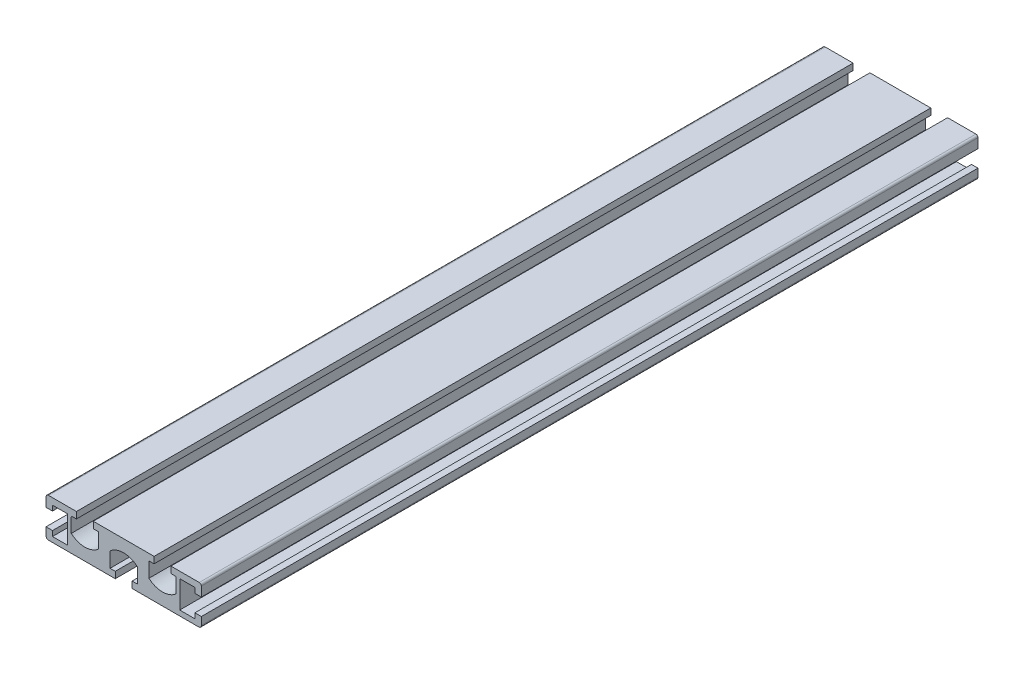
ISO-10303-21;
HEADER;
FILE_DESCRIPTION(('STEP AP214'),'2;1');
FILE_NAME('part.step','',(''),(''),'','','');
FILE_SCHEMA(('AUTOMOTIVE_DESIGN { 1 0 10303 214 1 1 1 1 }'));
ENDSEC;
DATA;
#1=APPLICATION_CONTEXT('core data for automotive mechanical design processes');
#2=APPLICATION_PROTOCOL_DEFINITION('international standard','automotive_design',2000,#1);
#3=PRODUCT_CONTEXT('',#1,'mechanical');
#4=PRODUCT('Part','Part','',(#3));
#5=PRODUCT_RELATED_PRODUCT_CATEGORY('part','',(#4));
#6=PRODUCT_DEFINITION_FORMATION('','',#4);
#7=PRODUCT_DEFINITION_CONTEXT('part definition',#1,'design');
#8=PRODUCT_DEFINITION('design','',#6,#7);
#9=PRODUCT_DEFINITION_SHAPE('','',#8);
#10=(LENGTH_UNIT() NAMED_UNIT(*) SI_UNIT(.MILLI.,.METRE.));
#11=(NAMED_UNIT(*) PLANE_ANGLE_UNIT() SI_UNIT($,.RADIAN.));
#12=(NAMED_UNIT(*) SI_UNIT($,.STERADIAN.) SOLID_ANGLE_UNIT());
#13=UNCERTAINTY_MEASURE_WITH_UNIT(LENGTH_MEASURE(1.E-05),#10,'distance_accuracy_value','');
#14=(GEOMETRIC_REPRESENTATION_CONTEXT(3) GLOBAL_UNCERTAINTY_ASSIGNED_CONTEXT((#13)) GLOBAL_UNIT_ASSIGNED_CONTEXT((#10,
#11,#12)) REPRESENTATION_CONTEXT('',''));
#15=CARTESIAN_POINT('',(0.,0.,0.));
#16=DIRECTION('',(0.,0.,1.));
#17=DIRECTION('',(1.,0.,0.));
#18=AXIS2_PLACEMENT_3D('',#15,#16,#17);
#19=CARTESIAN_POINT('',(9.74982438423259,-0.58926117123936,150.));
#20=DIRECTION('',(-0.999999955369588,0.000298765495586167,0.));
#21=DIRECTION('',(-0.000298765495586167,-0.999999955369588,0.));
#22=AXIS2_PLACEMENT_3D('',#19,#20,#21);
#23=PLANE('',#22);
#24=DIRECTION('',(0.000298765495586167,0.999999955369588,0.));
#25=VECTOR('',#24,1.);
#26=CARTESIAN_POINT('',(9.74982438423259,-0.58926117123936,-150.));
#27=LINE('',#26,#25);
#28=CARTESIAN_POINT('',(9.74982438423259,-0.589261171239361,-150.));
#29=VERTEX_POINT('',#28);
#30=CARTESIAN_POINT('',(9.75156808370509,5.24708680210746,-150.));
#31=VERTEX_POINT('',#30);
#32=EDGE_CURVE('E371',#29,#31,#27,.T.);
#33=ORIENTED_EDGE('',*,*,#32,.T.);
#34=DIRECTION('',(0.,0.,-1.));
#35=VECTOR('',#34,1.);
#36=CARTESIAN_POINT('',(9.75156808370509,5.24708680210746,150.));
#37=LINE('',#36,#35);
#38=CARTESIAN_POINT('',(9.75156808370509,5.24708680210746,150.));
#39=VERTEX_POINT('',#38);
#40=EDGE_CURVE('E11',#39,#31,#37,.T.);
#41=ORIENTED_EDGE('',*,*,#40,.F.);
#42=DIRECTION('',(0.000298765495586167,0.999999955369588,0.));
#43=VECTOR('',#42,1.);
#44=CARTESIAN_POINT('',(9.74982438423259,-0.58926117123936,150.));
#45=LINE('',#44,#43);
#46=CARTESIAN_POINT('',(9.74982438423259,-0.589261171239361,150.));
#47=VERTEX_POINT('',#46);
#48=EDGE_CURVE('E465',#47,#39,#45,.T.);
#49=ORIENTED_EDGE('',*,*,#48,.F.);
#50=DIRECTION('',(0.,0.,-1.));
#51=VECTOR('',#50,1.);
#52=CARTESIAN_POINT('',(9.74982438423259,-0.589261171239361,150.));
#53=LINE('',#52,#51);
#54=EDGE_CURVE('E367',#47,#29,#53,.T.);
#55=ORIENTED_EDGE('',*,*,#54,.T.);
#56=EDGE_LOOP('',(#33,#41,#49,#55));
#57=FACE_BOUND('',#56,.T.);
#58=ADVANCED_FACE('F35',(#57),#23,.F.);
#59=CARTESIAN_POINT('',(9.75156808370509,5.24708680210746,150.));
#60=DIRECTION('',(0.00029876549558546,0.999999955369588,0.));
#61=DIRECTION('',(-0.999999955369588,0.00029876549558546,0.));
#62=AXIS2_PLACEMENT_3D('',#59,#60,#61);
#63=PLANE('',#62);
#64=DIRECTION('',(0.999999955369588,-0.00029876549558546,0.));
#65=VECTOR('',#64,1.);
#66=CARTESIAN_POINT('',(9.75156808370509,5.24708680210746,-150.));
#67=LINE('',#66,#65);
#68=CARTESIAN_POINT('',(11.7515679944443,5.24648927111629,-150.));
#69=VERTEX_POINT('',#68);
#70=EDGE_CURVE('E374',#31,#69,#67,.T.);
#71=ORIENTED_EDGE('',*,*,#70,.T.);
#72=DIRECTION('',(0.,0.,-1.));
#73=VECTOR('',#72,1.);
#74=CARTESIAN_POINT('',(11.7515679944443,5.24648927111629,150.));
#75=LINE('',#74,#73);
#76=CARTESIAN_POINT('',(11.7515679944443,5.24648927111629,150.));
#77=VERTEX_POINT('',#76);
#78=EDGE_CURVE('E43',#77,#69,#75,.T.);
#79=ORIENTED_EDGE('',*,*,#78,.F.);
#80=DIRECTION('',(0.999999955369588,-0.00029876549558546,0.));
#81=VECTOR('',#80,1.);
#82=CARTESIAN_POINT('',(9.75156808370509,5.24708680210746,150.));
#83=LINE('',#82,#81);
#84=EDGE_CURVE('E214',#39,#77,#83,.T.);
#85=ORIENTED_EDGE('',*,*,#84,.F.);
#86=ORIENTED_EDGE('',*,*,#40,.T.);
#87=EDGE_LOOP('',(#71,#79,#85,#86));
#88=FACE_BOUND('',#87,.T.);
#89=ADVANCED_FACE('F723',(#88),#63,.F.);
#90=CARTESIAN_POINT('',(11.7515679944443,5.24648927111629,150.));
#91=DIRECTION('',(-0.999999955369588,0.000298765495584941,0.));
#92=DIRECTION('',(-0.000298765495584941,-0.999999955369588,0.));
#93=AXIS2_PLACEMENT_3D('',#90,#91,#92);
#94=PLANE('',#93);
#95=DIRECTION('',(0.000298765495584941,0.999999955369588,0.));
#96=VECTOR('',#95,1.);
#97=CARTESIAN_POINT('',(11.7515679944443,5.24648927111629,-150.));
#98=LINE('',#97,#96);
#99=CARTESIAN_POINT('',(11.7523149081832,7.74648915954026,-150.));
#100=VERTEX_POINT('',#99);
#101=EDGE_CURVE('E376',#69,#100,#98,.T.);
#102=ORIENTED_EDGE('',*,*,#101,.T.);
#103=DIRECTION('',(0.,0.,-1.));
#104=VECTOR('',#103,1.);
#105=CARTESIAN_POINT('',(11.7523149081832,7.74648915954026,150.));
#106=LINE('',#105,#104);
#107=CARTESIAN_POINT('',(11.7523149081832,7.74648915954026,150.));
#108=VERTEX_POINT('',#107);
#109=EDGE_CURVE('E592',#108,#100,#106,.T.);
#110=ORIENTED_EDGE('',*,*,#109,.F.);
#111=DIRECTION('',(0.000298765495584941,0.999999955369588,0.));
#112=VECTOR('',#111,1.);
#113=CARTESIAN_POINT('',(11.7515679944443,5.24648927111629,150.));
#114=LINE('',#113,#112);
#115=EDGE_CURVE('E600',#77,#108,#114,.T.);
#116=ORIENTED_EDGE('',*,*,#115,.F.);
#117=ORIENTED_EDGE('',*,*,#78,.T.);
#118=EDGE_LOOP('',(#102,#110,#116,#117));
#119=FACE_BOUND('',#118,.T.);
#120=ADVANCED_FACE('F598',(#119),#94,.F.);
#121=CARTESIAN_POINT('',(11.7523149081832,7.74648915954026,150.));
#122=DIRECTION('',(-0.000298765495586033,-0.999999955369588,0.));
#123=DIRECTION('',(0.999999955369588,-0.000298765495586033,0.));
#124=AXIS2_PLACEMENT_3D('',#121,#122,#123);
#125=PLANE('',#124);
#126=DIRECTION('',(-0.999999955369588,0.000298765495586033,0.));
#127=VECTOR('',#126,1.);
#128=CARTESIAN_POINT('',(11.7523149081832,7.74648915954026,-150.));
#129=LINE('',#128,#127);
#130=CARTESIAN_POINT('',(-11.7476840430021,7.75351014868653,-150.));
#131=VERTEX_POINT('',#130);
#132=EDGE_CURVE('E378',#100,#131,#129,.T.);
#133=ORIENTED_EDGE('',*,*,#132,.T.);
#134=DIRECTION('',(0.,0.,-1.));
#135=VECTOR('',#134,1.);
#136=CARTESIAN_POINT('',(-11.7476840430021,7.75351014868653,150.));
#137=LINE('',#136,#135);
#138=CARTESIAN_POINT('',(-11.7476840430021,7.75351014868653,150.));
#139=VERTEX_POINT('',#138);
#140=EDGE_CURVE('E589',#139,#131,#137,.T.);
#141=ORIENTED_EDGE('',*,*,#140,.F.);
#142=DIRECTION('',(-0.999999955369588,0.000298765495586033,0.));
#143=VECTOR('',#142,1.);
#144=CARTESIAN_POINT('',(11.7523149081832,7.74648915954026,150.));
#145=LINE('',#144,#143);
#146=EDGE_CURVE('E618',#108,#139,#145,.T.);
#147=ORIENTED_EDGE('',*,*,#146,.F.);
#148=ORIENTED_EDGE('',*,*,#109,.T.);
#149=EDGE_LOOP('',(#133,#141,#147,#148));
#150=FACE_BOUND('',#149,.T.);
#151=ADVANCED_FACE('F609',(#150),#125,.F.);
#152=CARTESIAN_POINT('',(-11.7476840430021,7.75351014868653,150.));
#153=DIRECTION('',(0.999999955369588,-0.000298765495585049,0.));
#154=DIRECTION('',(0.000298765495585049,0.999999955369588,0.));
#155=AXIS2_PLACEMENT_3D('',#152,#153,#154);
#156=PLANE('',#155);
#157=DIRECTION('',(-0.000298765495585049,-0.999999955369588,0.));
#158=VECTOR('',#157,1.);
#159=CARTESIAN_POINT('',(-11.7476840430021,7.75351014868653,-150.));
#160=LINE('',#159,#158);
#161=CARTESIAN_POINT('',(-11.7484309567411,5.25351026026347,-150.));
#162=VERTEX_POINT('',#161);
#163=EDGE_CURVE('E380',#131,#162,#160,.T.);
#164=ORIENTED_EDGE('',*,*,#163,.T.);
#165=DIRECTION('',(0.,0.,-1.));
#166=VECTOR('',#165,1.);
#167=CARTESIAN_POINT('',(-11.7484309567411,5.25351026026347,150.));
#168=LINE('',#167,#166);
#169=CARTESIAN_POINT('',(-11.7484309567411,5.25351026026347,150.));
#170=VERTEX_POINT('',#169);
#171=EDGE_CURVE('E586',#170,#162,#168,.T.);
#172=ORIENTED_EDGE('',*,*,#171,.F.);
#173=DIRECTION('',(-0.000298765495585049,-0.999999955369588,0.));
#174=VECTOR('',#173,1.);
#175=CARTESIAN_POINT('',(-11.7476840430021,7.75351014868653,150.));
#176=LINE('',#175,#174);
#177=EDGE_CURVE('E615',#139,#170,#176,.T.);
#178=ORIENTED_EDGE('',*,*,#177,.F.);
#179=ORIENTED_EDGE('',*,*,#140,.T.);
#180=EDGE_LOOP('',(#164,#172,#178,#179));
#181=FACE_BOUND('',#180,.T.);
#182=ADVANCED_FACE('F613',(#181),#156,.F.);
#183=CARTESIAN_POINT('',(-11.7484309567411,5.25351026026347,150.));
#184=DIRECTION('',(0.000298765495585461,0.999999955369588,0.));
#185=DIRECTION('',(-0.999999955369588,0.000298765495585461,0.));
#186=AXIS2_PLACEMENT_3D('',#183,#184,#185);
#187=PLANE('',#186);
#188=DIRECTION('',(0.999999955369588,-0.000298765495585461,0.));
#189=VECTOR('',#188,1.);
#190=CARTESIAN_POINT('',(-11.7484309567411,5.25351026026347,-150.));
#191=LINE('',#190,#189);
#192=CARTESIAN_POINT('',(-9.74843104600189,5.2529127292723,-150.));
#193=VERTEX_POINT('',#192);
#194=EDGE_CURVE('E382',#162,#193,#191,.T.);
#195=ORIENTED_EDGE('',*,*,#194,.T.);
#196=DIRECTION('',(0.,0.,-1.));
#197=VECTOR('',#196,1.);
#198=CARTESIAN_POINT('',(-9.74843104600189,5.2529127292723,150.));
#199=LINE('',#198,#197);
#200=CARTESIAN_POINT('',(-9.74843104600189,5.2529127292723,150.));
#201=VERTEX_POINT('',#200);
#202=EDGE_CURVE('E583',#201,#193,#199,.T.);
#203=ORIENTED_EDGE('',*,*,#202,.F.);
#204=DIRECTION('',(0.999999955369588,-0.000298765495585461,0.));
#205=VECTOR('',#204,1.);
#206=CARTESIAN_POINT('',(-11.7484309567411,5.25351026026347,150.));
#207=LINE('',#206,#205);
#208=EDGE_CURVE('E617',#170,#201,#207,.T.);
#209=ORIENTED_EDGE('',*,*,#208,.F.);
#210=ORIENTED_EDGE('',*,*,#171,.T.);
#211=EDGE_LOOP('',(#195,#203,#209,#210));
#212=FACE_BOUND('',#211,.T.);
#213=ADVANCED_FACE('F736',(#212),#187,.F.);
#214=CARTESIAN_POINT('',(-9.74843104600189,5.2529127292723,150.));
#215=DIRECTION('',(0.999999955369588,-0.000298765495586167,0.));
#216=DIRECTION('',(0.000298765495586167,0.999999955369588,0.));
#217=AXIS2_PLACEMENT_3D('',#214,#215,#216);
#218=PLANE('',#217);
#219=DIRECTION('',(-0.000298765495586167,-0.999999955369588,0.));
#220=VECTOR('',#219,1.);
#221=CARTESIAN_POINT('',(-9.74843104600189,5.2529127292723,-150.));
#222=LINE('',#221,#220);
#223=CARTESIAN_POINT('',(-9.75017474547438,-0.583435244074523,-150.));
#224=VERTEX_POINT('',#223);
#225=EDGE_CURVE('E384',#193,#224,#222,.T.);
#226=ORIENTED_EDGE('',*,*,#225,.T.);
#227=DIRECTION('',(0.,0.,-1.));
#228=VECTOR('',#227,1.);
#229=CARTESIAN_POINT('',(-9.75017474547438,-0.583435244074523,150.));
#230=LINE('',#229,#228);
#231=CARTESIAN_POINT('',(-9.75017474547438,-0.583435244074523,150.));
#232=VERTEX_POINT('',#231);
#233=EDGE_CURVE('E580',#232,#224,#230,.T.);
#234=ORIENTED_EDGE('',*,*,#233,.F.);
#235=DIRECTION('',(-0.000298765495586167,-0.999999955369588,0.));
#236=VECTOR('',#235,1.);
#237=CARTESIAN_POINT('',(-9.74843104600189,5.2529127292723,150.));
#238=LINE('',#237,#236);
#239=EDGE_CURVE('E620',#201,#232,#238,.T.);
#240=ORIENTED_EDGE('',*,*,#239,.F.);
#241=ORIENTED_EDGE('',*,*,#202,.T.);
#242=EDGE_LOOP('',(#226,#234,#240,#241));
#243=FACE_BOUND('',#242,.T.);
#244=ADVANCED_FACE('F739',(#243),#218,.F.);
#245=CARTESIAN_POINT('',(-14.9983710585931,5.45448123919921,150.));
#246=DIRECTION('',(0.,0.,-1.));
#247=DIRECTION('',(-1.,0.,0.));
#248=AXIS2_PLACEMENT_3D('',#245,#246,#247);
#249=CYLINDRICAL_SURFACE('',#248,8.00000000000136);
#250=CARTESIAN_POINT('',(-14.9983710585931,5.45448123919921,-150.));
#251=DIRECTION('',(0.,0.,-1.));
#252=DIRECTION('',(1.,0.,0.));
#253=AXIS2_PLACEMENT_3D('',#250,#251,#252);
#254=CIRCLE('',#253,8.00000000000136);
#255=CARTESIAN_POINT('',(-20.2501742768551,-0.580298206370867,-150.));
#256=VERTEX_POINT('',#255);
#257=EDGE_CURVE('E386',#224,#256,#254,.T.);
#258=ORIENTED_EDGE('',*,*,#257,.T.);
#259=DIRECTION('',(0.,0.,-1.));
#260=VECTOR('',#259,1.);
#261=CARTESIAN_POINT('',(-20.2501742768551,-0.580298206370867,150.));
#262=LINE('',#261,#260);
#263=CARTESIAN_POINT('',(-20.2501742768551,-0.580298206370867,150.));
#264=VERTEX_POINT('',#263);
#265=EDGE_CURVE('E577',#264,#256,#262,.T.);
#266=ORIENTED_EDGE('',*,*,#265,.F.);
#267=CARTESIAN_POINT('',(-14.9983710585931,5.45448123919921,150.));
#268=DIRECTION('',(0.,0.,-1.));
#269=DIRECTION('',(1.,0.,0.));
#270=AXIS2_PLACEMENT_3D('',#267,#268,#269);
#271=CIRCLE('',#270,8.00000000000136);
#272=EDGE_CURVE('E626',#232,#264,#271,.T.);
#273=ORIENTED_EDGE('',*,*,#272,.F.);
#274=ORIENTED_EDGE('',*,*,#233,.T.);
#275=EDGE_LOOP('',(#258,#266,#273,#274));
#276=FACE_BOUND('',#275,.T.);
#277=ADVANCED_FACE('F743',(#276),#249,.F.);
#278=CARTESIAN_POINT('',(-20.2501742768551,-0.580298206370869,150.));
#279=DIRECTION('',(-0.999999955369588,0.000298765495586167,0.));
#280=DIRECTION('',(-0.000298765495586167,-0.999999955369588,0.));
#281=AXIS2_PLACEMENT_3D('',#278,#279,#280);
#282=PLANE('',#281);
#283=DIRECTION('',(0.000298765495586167,0.999999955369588,0.));
#284=VECTOR('',#283,1.);
#285=CARTESIAN_POINT('',(-20.2501742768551,-0.580298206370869,-150.));
#286=LINE('',#285,#284);
#287=CARTESIAN_POINT('',(-20.2484305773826,5.25604976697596,-150.));
#288=VERTEX_POINT('',#287);
#289=EDGE_CURVE('E388',#256,#288,#286,.T.);
#290=ORIENTED_EDGE('',*,*,#289,.T.);
#291=DIRECTION('',(0.,0.,-1.));
#292=VECTOR('',#291,1.);
#293=CARTESIAN_POINT('',(-20.2484305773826,5.25604976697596,150.));
#294=LINE('',#293,#292);
#295=CARTESIAN_POINT('',(-20.2484305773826,5.25604976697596,150.));
#296=VERTEX_POINT('',#295);
#297=EDGE_CURVE('E574',#296,#288,#294,.T.);
#298=ORIENTED_EDGE('',*,*,#297,.F.);
#299=DIRECTION('',(0.000298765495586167,0.999999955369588,0.));
#300=VECTOR('',#299,1.);
#301=CARTESIAN_POINT('',(-20.2501742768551,-0.580298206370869,150.));
#302=LINE('',#301,#300);
#303=EDGE_CURVE('E628',#264,#296,#302,.T.);
#304=ORIENTED_EDGE('',*,*,#303,.F.);
#305=ORIENTED_EDGE('',*,*,#265,.T.);
#306=EDGE_LOOP('',(#290,#298,#304,#305));
#307=FACE_BOUND('',#306,.T.);
#308=ADVANCED_FACE('F747',(#307),#282,.F.);
#309=CARTESIAN_POINT('',(-20.2484305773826,5.25604976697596,150.));
#310=DIRECTION('',(0.000298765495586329,0.999999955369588,0.));
#311=DIRECTION('',(-0.999999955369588,0.000298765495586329,0.));
#312=AXIS2_PLACEMENT_3D('',#309,#310,#311);
#313=PLANE('',#312);
#314=DIRECTION('',(0.999999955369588,-0.000298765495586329,0.));
#315=VECTOR('',#314,1.);
#316=CARTESIAN_POINT('',(-20.2484305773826,5.25604976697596,-150.));
#317=LINE('',#316,#315);
#318=CARTESIAN_POINT('',(-18.2484306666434,5.25545223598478,-150.));
#319=VERTEX_POINT('',#318);
#320=EDGE_CURVE('E390',#288,#319,#317,.T.);
#321=ORIENTED_EDGE('',*,*,#320,.T.);
#322=DIRECTION('',(0.,0.,-1.));
#323=VECTOR('',#322,1.);
#324=CARTESIAN_POINT('',(-18.2484306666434,5.25545223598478,150.));
#325=LINE('',#324,#323);
#326=CARTESIAN_POINT('',(-18.2484306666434,5.25545223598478,150.));
#327=VERTEX_POINT('',#326);
#328=EDGE_CURVE('E571',#327,#319,#325,.T.);
#329=ORIENTED_EDGE('',*,*,#328,.F.);
#330=DIRECTION('',(0.999999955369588,-0.000298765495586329,0.));
#331=VECTOR('',#330,1.);
#332=CARTESIAN_POINT('',(-20.2484305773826,5.25604976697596,150.));
#333=LINE('',#332,#331);
#334=EDGE_CURVE('E630',#296,#327,#333,.T.);
#335=ORIENTED_EDGE('',*,*,#334,.F.);
#336=ORIENTED_EDGE('',*,*,#297,.T.);
#337=EDGE_LOOP('',(#321,#329,#335,#336));
#338=FACE_BOUND('',#337,.T.);
#339=ADVANCED_FACE('F751',(#338),#313,.F.);
#340=CARTESIAN_POINT('',(-18.2484306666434,5.25545223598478,150.));
#341=DIRECTION('',(-0.999999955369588,0.000298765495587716,0.));
#342=DIRECTION('',(-0.000298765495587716,-0.999999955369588,0.));
#343=AXIS2_PLACEMENT_3D('',#340,#341,#342);
#344=PLANE('',#343);
#345=DIRECTION('',(0.000298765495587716,0.999999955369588,0.));
#346=VECTOR('',#345,1.);
#347=CARTESIAN_POINT('',(-18.2484306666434,5.25545223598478,-150.));
#348=LINE('',#347,#346);
#349=CARTESIAN_POINT('',(-18.2476837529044,7.75545212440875,-150.));
#350=VERTEX_POINT('',#349);
#351=EDGE_CURVE('E392',#319,#350,#348,.T.);
#352=ORIENTED_EDGE('',*,*,#351,.T.);
#353=DIRECTION('',(0.,0.,-1.));
#354=VECTOR('',#353,1.);
#355=CARTESIAN_POINT('',(-18.2476837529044,7.75545212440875,150.));
#356=LINE('',#355,#354);
#357=CARTESIAN_POINT('',(-18.2476837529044,7.75545212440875,150.));
#358=VERTEX_POINT('',#357);
#359=EDGE_CURVE('E568',#358,#350,#356,.T.);
#360=ORIENTED_EDGE('',*,*,#359,.F.);
#361=DIRECTION('',(0.000298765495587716,0.999999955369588,0.));
#362=VECTOR('',#361,1.);
#363=CARTESIAN_POINT('',(-18.2484306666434,5.25545223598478,150.));
#364=LINE('',#363,#362);
#365=EDGE_CURVE('E632',#327,#358,#364,.T.);
#366=ORIENTED_EDGE('',*,*,#365,.F.);
#367=ORIENTED_EDGE('',*,*,#328,.T.);
#368=EDGE_LOOP('',(#352,#360,#366,#367));
#369=FACE_BOUND('',#368,.T.);
#370=ADVANCED_FACE('F755',(#369),#344,.F.);
#371=CARTESIAN_POINT('',(-18.2476837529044,7.75545212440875,150.));
#372=DIRECTION('',(-0.000298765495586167,-0.999999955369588,0.));
#373=DIRECTION('',(0.999999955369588,-0.000298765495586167,0.));
#374=AXIS2_PLACEMENT_3D('',#371,#372,#373);
#375=PLANE('',#374);
#376=DIRECTION('',(-0.999999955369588,0.000298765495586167,0.));
#377=VECTOR('',#376,1.);
#378=CARTESIAN_POINT('',(-18.2476837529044,7.75545212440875,-150.));
#379=LINE('',#378,#377);
#380=CARTESIAN_POINT('',(-28.9976832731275,7.75866385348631,-150.));
#381=VERTEX_POINT('',#380);
#382=EDGE_CURVE('E394',#350,#381,#379,.T.);
#383=ORIENTED_EDGE('',*,*,#382,.T.);
#384=DIRECTION('',(0.,0.,-1.));
#385=VECTOR('',#384,1.);
#386=CARTESIAN_POINT('',(-28.9976832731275,7.75866385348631,150.));
#387=LINE('',#386,#385);
#388=CARTESIAN_POINT('',(-28.9976832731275,7.75866385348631,150.));
#389=VERTEX_POINT('',#388);
#390=EDGE_CURVE('E565',#389,#381,#387,.T.);
#391=ORIENTED_EDGE('',*,*,#390,.F.);
#392=DIRECTION('',(-0.999999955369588,0.000298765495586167,0.));
#393=VECTOR('',#392,1.);
#394=CARTESIAN_POINT('',(-18.2476837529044,7.75545212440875,150.));
#395=LINE('',#394,#393);
#396=EDGE_CURVE('E634',#358,#389,#395,.T.);
#397=ORIENTED_EDGE('',*,*,#396,.F.);
#398=ORIENTED_EDGE('',*,*,#359,.T.);
#399=EDGE_LOOP('',(#383,#391,#397,#398));
#400=FACE_BOUND('',#399,.T.);
#401=ADVANCED_FACE('F759',(#400),#375,.F.);
#402=CARTESIAN_POINT('',(-28.9979820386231,6.75866389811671,150.));
#403=DIRECTION('',(0.,0.,-1.));
#404=DIRECTION('',(-1.,0.,0.));
#405=AXIS2_PLACEMENT_3D('',#402,#403,#404);
#406=CYLINDRICAL_SURFACE('',#405,1.00000000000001);
#407=CARTESIAN_POINT('',(-28.9979820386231,6.75866389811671,-150.));
#408=DIRECTION('',(0.,0.,1.));
#409=DIRECTION('',(1.,0.,0.));
#410=AXIS2_PLACEMENT_3D('',#407,#408,#409);
#411=CIRCLE('',#410,1.00000000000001);
#412=CARTESIAN_POINT('',(-29.9979819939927,6.7589626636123,-150.));
#413=VERTEX_POINT('',#412);
#414=EDGE_CURVE('E396',#381,#413,#411,.T.);
#415=ORIENTED_EDGE('',*,*,#414,.T.);
#416=DIRECTION('',(0.,0.,-1.));
#417=VECTOR('',#416,1.);
#418=CARTESIAN_POINT('',(-29.9979819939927,6.7589626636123,150.));
#419=LINE('',#418,#417);
#420=CARTESIAN_POINT('',(-29.9979819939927,6.7589626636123,150.));
#421=VERTEX_POINT('',#420);
#422=EDGE_CURVE('E562',#421,#413,#419,.T.);
#423=ORIENTED_EDGE('',*,*,#422,.F.);
#424=CARTESIAN_POINT('',(-28.9979820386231,6.75866389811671,150.));
#425=DIRECTION('',(0.,0.,1.));
#426=DIRECTION('',(1.,0.,0.));
#427=AXIS2_PLACEMENT_3D('',#424,#425,#426);
#428=CIRCLE('',#427,1.00000000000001);
#429=EDGE_CURVE('E636',#389,#421,#428,.T.);
#430=ORIENTED_EDGE('',*,*,#429,.F.);
#431=ORIENTED_EDGE('',*,*,#390,.T.);
#432=EDGE_LOOP('',(#415,#423,#430,#431));
#433=FACE_BOUND('',#432,.T.);
#434=ADVANCED_FACE('F763',(#433),#406,.T.);
#435=CARTESIAN_POINT('',(-29.9979819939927,6.7589626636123,150.));
#436=DIRECTION('',(0.999999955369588,-0.000298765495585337,0.));
#437=DIRECTION('',(0.000298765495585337,0.999999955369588,0.));
#438=AXIS2_PLACEMENT_3D('',#435,#436,#437);
#439=PLANE('',#438);
#440=DIRECTION('',(-0.000298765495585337,-0.999999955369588,0.));
#441=VECTOR('',#440,1.);
#442=CARTESIAN_POINT('',(-29.9979819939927,6.7589626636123,-150.));
#443=LINE('',#442,#441);
#444=CARTESIAN_POINT('',(-29.9990276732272,3.25896281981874,-150.));
#445=VERTEX_POINT('',#444);
#446=EDGE_CURVE('E398',#413,#445,#443,.T.);
#447=ORIENTED_EDGE('',*,*,#446,.T.);
#448=DIRECTION('',(0.,0.,-1.));
#449=VECTOR('',#448,1.);
#450=CARTESIAN_POINT('',(-29.9990276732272,3.25896281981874,150.));
#451=LINE('',#450,#449);
#452=CARTESIAN_POINT('',(-29.9990276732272,3.25896281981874,150.));
#453=VERTEX_POINT('',#452);
#454=EDGE_CURVE('E559',#453,#445,#451,.T.);
#455=ORIENTED_EDGE('',*,*,#454,.F.);
#456=DIRECTION('',(-0.000298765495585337,-0.999999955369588,0.));
#457=VECTOR('',#456,1.);
#458=CARTESIAN_POINT('',(-29.9979819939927,6.7589626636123,150.));
#459=LINE('',#458,#457);
#460=EDGE_CURVE('E638',#421,#453,#459,.T.);
#461=ORIENTED_EDGE('',*,*,#460,.F.);
#462=ORIENTED_EDGE('',*,*,#422,.T.);
#463=EDGE_LOOP('',(#447,#455,#461,#462));
#464=FACE_BOUND('',#463,.T.);
#465=ADVANCED_FACE('F767',(#464),#439,.F.);
#466=CARTESIAN_POINT('',(-29.9990276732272,3.25896281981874,150.));
#467=DIRECTION('',(0.000298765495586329,0.999999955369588,0.));
#468=DIRECTION('',(-0.999999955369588,0.000298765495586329,0.));
#469=AXIS2_PLACEMENT_3D('',#466,#467,#468);
#470=PLANE('',#469);
#471=DIRECTION('',(0.999999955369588,-0.000298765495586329,0.));
#472=VECTOR('',#471,1.);
#473=CARTESIAN_POINT('',(-29.9990276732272,3.25896281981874,-150.));
#474=LINE('',#473,#472);
#475=CARTESIAN_POINT('',(-27.4990277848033,3.25821590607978,-150.));
#476=VERTEX_POINT('',#475);
#477=EDGE_CURVE('E400',#445,#476,#474,.T.);
#478=ORIENTED_EDGE('',*,*,#477,.T.);
#479=DIRECTION('',(0.,0.,-1.));
#480=VECTOR('',#479,1.);
#481=CARTESIAN_POINT('',(-27.4990277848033,3.25821590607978,150.));
#482=LINE('',#481,#480);
#483=CARTESIAN_POINT('',(-27.4990277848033,3.25821590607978,150.));
#484=VERTEX_POINT('',#483);
#485=EDGE_CURVE('E556',#484,#476,#482,.T.);
#486=ORIENTED_EDGE('',*,*,#485,.F.);
#487=DIRECTION('',(0.999999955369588,-0.000298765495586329,0.));
#488=VECTOR('',#487,1.);
#489=CARTESIAN_POINT('',(-29.9990276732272,3.25896281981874,150.));
#490=LINE('',#489,#488);
#491=EDGE_CURVE('E640',#453,#484,#490,.T.);
#492=ORIENTED_EDGE('',*,*,#491,.F.);
#493=ORIENTED_EDGE('',*,*,#454,.T.);
#494=EDGE_LOOP('',(#478,#486,#492,#493));
#495=FACE_BOUND('',#494,.T.);
#496=ADVANCED_FACE('F771',(#495),#470,.F.);
#497=CARTESIAN_POINT('',(-27.4990277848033,3.25821590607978,150.));
#498=DIRECTION('',(-0.999999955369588,0.000298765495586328,0.));
#499=DIRECTION('',(-0.000298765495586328,-0.999999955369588,0.));
#500=AXIS2_PLACEMENT_3D('',#497,#498,#499);
#501=PLANE('',#500);
#502=DIRECTION('',(0.000298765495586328,0.999999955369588,0.));
#503=VECTOR('',#502,1.);
#504=CARTESIAN_POINT('',(-27.4990277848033,3.25821590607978,-150.));
#505=LINE('',#504,#503);
#506=CARTESIAN_POINT('',(-27.4984302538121,5.25821581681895,-150.));
#507=VERTEX_POINT('',#506);
#508=EDGE_CURVE('E402',#476,#507,#505,.T.);
#509=ORIENTED_EDGE('',*,*,#508,.T.);
#510=DIRECTION('',(0.,0.,-1.));
#511=VECTOR('',#510,1.);
#512=CARTESIAN_POINT('',(-27.4984302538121,5.25821581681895,150.));
#513=LINE('',#512,#511);
#514=CARTESIAN_POINT('',(-27.4984302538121,5.25821581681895,150.));
#515=VERTEX_POINT('',#514);
#516=EDGE_CURVE('E553',#515,#507,#513,.T.);
#517=ORIENTED_EDGE('',*,*,#516,.F.);
#518=DIRECTION('',(0.000298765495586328,0.999999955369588,0.));
#519=VECTOR('',#518,1.);
#520=CARTESIAN_POINT('',(-27.4990277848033,3.25821590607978,150.));
#521=LINE('',#520,#519);
#522=EDGE_CURVE('E642',#484,#515,#521,.T.);
#523=ORIENTED_EDGE('',*,*,#522,.F.);
#524=ORIENTED_EDGE('',*,*,#485,.T.);
#525=EDGE_LOOP('',(#509,#517,#523,#524));
#526=FACE_BOUND('',#525,.T.);
#527=ADVANCED_FACE('F775',(#526),#501,.F.);
#528=CARTESIAN_POINT('',(-27.4984302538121,5.25821581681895,150.));
#529=DIRECTION('',(0.000298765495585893,0.999999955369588,0.));
#530=DIRECTION('',(-0.999999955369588,0.000298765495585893,0.));
#531=AXIS2_PLACEMENT_3D('',#528,#529,#530);
#532=PLANE('',#531);
#533=DIRECTION('',(0.999999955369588,-0.000298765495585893,0.));
#534=VECTOR('',#533,1.);
#535=CARTESIAN_POINT('',(-27.4984302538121,5.25821581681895,-150.));
#536=LINE('',#535,#534);
#537=CARTESIAN_POINT('',(-21.6620822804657,5.25647211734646,-150.));
#538=VERTEX_POINT('',#537);
#539=EDGE_CURVE('E404',#507,#538,#536,.T.);
#540=ORIENTED_EDGE('',*,*,#539,.T.);
#541=DIRECTION('',(0.,0.,-1.));
#542=VECTOR('',#541,1.);
#543=CARTESIAN_POINT('',(-21.6620822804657,5.25647211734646,150.));
#544=LINE('',#543,#542);
#545=CARTESIAN_POINT('',(-21.6620822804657,5.25647211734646,150.));
#546=VERTEX_POINT('',#545);
#547=EDGE_CURVE('E550',#546,#538,#544,.T.);
#548=ORIENTED_EDGE('',*,*,#547,.F.);
#549=DIRECTION('',(0.999999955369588,-0.000298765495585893,0.));
#550=VECTOR('',#549,1.);
#551=CARTESIAN_POINT('',(-27.4984302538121,5.25821581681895,150.));
#552=LINE('',#551,#550);
#553=EDGE_CURVE('E644',#515,#546,#552,.T.);
#554=ORIENTED_EDGE('',*,*,#553,.F.);
#555=ORIENTED_EDGE('',*,*,#516,.T.);
#556=EDGE_LOOP('',(#540,#548,#554,#555));
#557=FACE_BOUND('',#556,.T.);
#558=ADVANCED_FACE('F779',(#557),#532,.F.);
#559=CARTESIAN_POINT('',(-21.6620822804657,5.25647211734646,150.));
#560=DIRECTION('',(0.999999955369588,-0.000298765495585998,0.));
#561=DIRECTION('',(0.000298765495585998,0.999999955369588,0.));
#562=AXIS2_PLACEMENT_3D('',#559,#560,#561);
#563=PLANE('',#562);
#564=DIRECTION('',(-0.000298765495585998,-0.999999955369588,0.));
#565=VECTOR('',#564,1.);
#566=CARTESIAN_POINT('',(-21.6620822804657,5.25647211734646,-150.));
#567=LINE('',#566,#565);
#568=CARTESIAN_POINT('',(-21.6652193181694,-5.24352741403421,-150.));
#569=VERTEX_POINT('',#568);
#570=EDGE_CURVE('E406',#538,#569,#567,.T.);
#571=ORIENTED_EDGE('',*,*,#570,.T.);
#572=DIRECTION('',(0.,0.,-1.));
#573=VECTOR('',#572,1.);
#574=CARTESIAN_POINT('',(-21.6652193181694,-5.24352741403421,150.));
#575=LINE('',#574,#573);
#576=CARTESIAN_POINT('',(-21.6652193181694,-5.24352741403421,150.));
#577=VERTEX_POINT('',#576);
#578=EDGE_CURVE('E547',#577,#569,#575,.T.);
#579=ORIENTED_EDGE('',*,*,#578,.F.);
#580=DIRECTION('',(-0.000298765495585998,-0.999999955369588,0.));
#581=VECTOR('',#580,1.);
#582=CARTESIAN_POINT('',(-21.6620822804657,5.25647211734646,150.));
#583=LINE('',#582,#581);
#584=EDGE_CURVE('E646',#546,#577,#583,.T.);
#585=ORIENTED_EDGE('',*,*,#584,.F.);
#586=ORIENTED_EDGE('',*,*,#547,.T.);
#587=EDGE_LOOP('',(#571,#579,#585,#586));
#588=FACE_BOUND('',#587,.T.);
#589=ADVANCED_FACE('F783',(#588),#563,.F.);
#590=CARTESIAN_POINT('',(-21.6652193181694,-5.24352741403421,150.));
#591=DIRECTION('',(-0.000298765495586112,-0.999999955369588,0.));
#592=DIRECTION('',(0.999999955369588,-0.000298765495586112,0.));
#593=AXIS2_PLACEMENT_3D('',#590,#591,#592);
#594=PLANE('',#593);
#595=DIRECTION('',(-0.999999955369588,0.000298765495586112,0.));
#596=VECTOR('',#595,1.);
#597=CARTESIAN_POINT('',(-21.6652193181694,-5.24352741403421,-150.));
#598=LINE('',#597,#596);
#599=CARTESIAN_POINT('',(-27.5015672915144,-5.24178371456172,-150.));
#600=VERTEX_POINT('',#599);
#601=EDGE_CURVE('E408',#569,#600,#598,.T.);
#602=ORIENTED_EDGE('',*,*,#601,.T.);
#603=DIRECTION('',(0.,0.,-1.));
#604=VECTOR('',#603,1.);
#605=CARTESIAN_POINT('',(-27.5015672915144,-5.24178371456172,150.));
#606=LINE('',#605,#604);
#607=CARTESIAN_POINT('',(-27.5015672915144,-5.24178371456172,150.));
#608=VERTEX_POINT('',#607);
#609=EDGE_CURVE('E544',#608,#600,#606,.T.);
#610=ORIENTED_EDGE('',*,*,#609,.F.);
#611=DIRECTION('',(-0.999999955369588,0.000298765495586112,0.));
#612=VECTOR('',#611,1.);
#613=CARTESIAN_POINT('',(-21.6652193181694,-5.24352741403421,150.));
#614=LINE('',#613,#612);
#615=EDGE_CURVE('E648',#577,#608,#614,.T.);
#616=ORIENTED_EDGE('',*,*,#615,.F.);
#617=ORIENTED_EDGE('',*,*,#578,.T.);
#618=EDGE_LOOP('',(#602,#610,#616,#617));
#619=FACE_BOUND('',#618,.T.);
#620=ADVANCED_FACE('F787',(#619),#594,.F.);
#621=CARTESIAN_POINT('',(-27.5015672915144,-5.24178371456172,150.));
#622=DIRECTION('',(-0.999999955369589,0.00029876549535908,0.));
#623=DIRECTION('',(-0.00029876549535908,-0.999999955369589,0.));
#624=AXIS2_PLACEMENT_3D('',#621,#622,#623);
#625=PLANE('',#624);
#626=DIRECTION('',(0.00029876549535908,0.999999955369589,0.));
#627=VECTOR('',#626,1.);
#628=CARTESIAN_POINT('',(-27.5015672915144,-5.24178371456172,-150.));
#629=LINE('',#628,#627);
#630=CARTESIAN_POINT('',(-27.5009697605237,-3.24178380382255,-150.));
#631=VERTEX_POINT('',#630);
#632=EDGE_CURVE('E410',#600,#631,#629,.T.);
#633=ORIENTED_EDGE('',*,*,#632,.T.);
#634=DIRECTION('',(0.,0.,-1.));
#635=VECTOR('',#634,1.);
#636=CARTESIAN_POINT('',(-27.5009697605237,-3.24178380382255,150.));
#637=LINE('',#636,#635);
#638=CARTESIAN_POINT('',(-27.5009697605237,-3.24178380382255,150.));
#639=VERTEX_POINT('',#638);
#640=EDGE_CURVE('E541',#639,#631,#637,.T.);
#641=ORIENTED_EDGE('',*,*,#640,.F.);
#642=DIRECTION('',(0.00029876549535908,0.999999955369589,0.));
#643=VECTOR('',#642,1.);
#644=CARTESIAN_POINT('',(-27.5015672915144,-5.24178371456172,150.));
#645=LINE('',#644,#643);
#646=EDGE_CURVE('E650',#608,#639,#645,.T.);
#647=ORIENTED_EDGE('',*,*,#646,.F.);
#648=ORIENTED_EDGE('',*,*,#609,.T.);
#649=EDGE_LOOP('',(#633,#641,#647,#648));
#650=FACE_BOUND('',#649,.T.);
#651=ADVANCED_FACE('F791',(#650),#625,.F.);
#652=CARTESIAN_POINT('',(-27.5009697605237,-3.24178380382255,150.));
#653=DIRECTION('',(-0.000298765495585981,-0.999999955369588,0.));
#654=DIRECTION('',(0.999999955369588,-0.000298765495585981,0.));
#655=AXIS2_PLACEMENT_3D('',#652,#653,#654);
#656=PLANE('',#655);
#657=DIRECTION('',(-0.999999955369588,0.000298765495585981,0.));
#658=VECTOR('',#657,1.);
#659=CARTESIAN_POINT('',(-27.5009697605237,-3.24178380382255,-150.));
#660=LINE('',#659,#658);
#661=CARTESIAN_POINT('',(-30.0009696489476,-3.24103689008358,-150.));
#662=VERTEX_POINT('',#661);
#663=EDGE_CURVE('E412',#631,#662,#660,.T.);
#664=ORIENTED_EDGE('',*,*,#663,.T.);
#665=DIRECTION('',(0.,0.,-1.));
#666=VECTOR('',#665,1.);
#667=CARTESIAN_POINT('',(-30.0009696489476,-3.24103689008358,150.));
#668=LINE('',#667,#666);
#669=CARTESIAN_POINT('',(-30.0009696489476,-3.24103689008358,150.));
#670=VERTEX_POINT('',#669);
#671=EDGE_CURVE('E538',#670,#662,#668,.T.);
#672=ORIENTED_EDGE('',*,*,#671,.F.);
#673=DIRECTION('',(-0.999999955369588,0.000298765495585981,0.));
#674=VECTOR('',#673,1.);
#675=CARTESIAN_POINT('',(-27.5009697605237,-3.24178380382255,150.));
#676=LINE('',#675,#674);
#677=EDGE_CURVE('E652',#639,#670,#676,.T.);
#678=ORIENTED_EDGE('',*,*,#677,.F.);
#679=ORIENTED_EDGE('',*,*,#640,.T.);
#680=EDGE_LOOP('',(#664,#672,#678,#679));
#681=FACE_BOUND('',#680,.T.);
#682=ADVANCED_FACE('F795',(#681),#656,.F.);
#683=CARTESIAN_POINT('',(-30.0009696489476,-3.24103689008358,150.));
#684=DIRECTION('',(0.999999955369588,-0.000298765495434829,0.));
#685=DIRECTION('',(0.000298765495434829,0.999999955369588,0.));
#686=AXIS2_PLACEMENT_3D('',#683,#684,#685);
#687=PLANE('',#686);
#688=DIRECTION('',(-0.000298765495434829,-0.999999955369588,0.));
#689=VECTOR('',#688,1.);
#690=CARTESIAN_POINT('',(-30.0009696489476,-3.24103689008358,-150.));
#691=LINE('',#690,#689);
#692=CARTESIAN_POINT('',(-30.0018659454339,-6.24103675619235,-150.));
#693=VERTEX_POINT('',#692);
#694=EDGE_CURVE('E414',#662,#693,#691,.T.);
#695=ORIENTED_EDGE('',*,*,#694,.T.);
#696=DIRECTION('',(0.,0.,-1.));
#697=VECTOR('',#696,1.);
#698=CARTESIAN_POINT('',(-30.0018659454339,-6.24103675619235,150.));
#699=LINE('',#698,#697);
#700=CARTESIAN_POINT('',(-30.0018659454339,-6.24103675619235,150.));
#701=VERTEX_POINT('',#700);
#702=EDGE_CURVE('E535',#701,#693,#699,.T.);
#703=ORIENTED_EDGE('',*,*,#702,.F.);
#704=DIRECTION('',(-0.000298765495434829,-0.999999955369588,0.));
#705=VECTOR('',#704,1.);
#706=CARTESIAN_POINT('',(-30.0009696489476,-3.24103689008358,150.));
#707=LINE('',#706,#705);
#708=EDGE_CURVE('E654',#670,#701,#707,.T.);
#709=ORIENTED_EDGE('',*,*,#708,.F.);
#710=ORIENTED_EDGE('',*,*,#671,.T.);
#711=EDGE_LOOP('',(#695,#703,#709,#710));
#712=FACE_BOUND('',#711,.T.);
#713=ADVANCED_FACE('F799',(#712),#687,.F.);
#714=CARTESIAN_POINT('',(-29.0018659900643,-6.24133552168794,150.));
#715=DIRECTION('',(0.,0.,-1.));
#716=DIRECTION('',(-1.,0.,0.));
#717=AXIS2_PLACEMENT_3D('',#714,#715,#716);
#718=CYLINDRICAL_SURFACE('',#717,0.99999999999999);
#719=CARTESIAN_POINT('',(-29.0018659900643,-6.24133552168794,-150.));
#720=DIRECTION('',(0.,0.,1.));
#721=DIRECTION('',(1.,0.,0.));
#722=AXIS2_PLACEMENT_3D('',#719,#720,#721);
#723=CIRCLE('',#722,0.99999999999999);
#724=CARTESIAN_POINT('',(-29.0021647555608,-7.24133547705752,-150.));
#725=VERTEX_POINT('',#724);
#726=EDGE_CURVE('E416',#693,#725,#723,.T.);
#727=ORIENTED_EDGE('',*,*,#726,.T.);
#728=DIRECTION('',(0.,0.,-1.));
#729=VECTOR('',#728,1.);
#730=CARTESIAN_POINT('',(-29.0021647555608,-7.24133547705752,150.));
#731=LINE('',#730,#729);
#732=CARTESIAN_POINT('',(-29.0021647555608,-7.24133547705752,150.));
#733=VERTEX_POINT('',#732);
#734=EDGE_CURVE('E532',#733,#725,#731,.T.);
#735=ORIENTED_EDGE('',*,*,#734,.F.);
#736=CARTESIAN_POINT('',(-29.0018659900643,-6.24133552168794,150.));
#737=DIRECTION('',(0.,0.,1.));
#738=DIRECTION('',(1.,0.,0.));
#739=AXIS2_PLACEMENT_3D('',#736,#737,#738);
#740=CIRCLE('',#739,0.99999999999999);
#741=EDGE_CURVE('E656',#701,#733,#740,.T.);
#742=ORIENTED_EDGE('',*,*,#741,.F.);
#743=ORIENTED_EDGE('',*,*,#702,.T.);
#744=EDGE_LOOP('',(#727,#735,#742,#743));
#745=FACE_BOUND('',#744,.T.);
#746=ADVANCED_FACE('F803',(#745),#718,.T.);
#747=CARTESIAN_POINT('',(-29.0021647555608,-7.24133547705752,150.));
#748=DIRECTION('',(0.000298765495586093,0.999999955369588,0.));
#749=DIRECTION('',(-0.999999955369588,0.000298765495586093,0.));
#750=AXIS2_PLACEMENT_3D('',#747,#748,#749);
#751=PLANE('',#750);
#752=DIRECTION('',(0.999999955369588,-0.000298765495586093,0.));
#753=VECTOR('',#752,1.);
#754=CARTESIAN_POINT('',(-29.0021647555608,-7.24133547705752,-150.));
#755=LINE('',#754,#753);
#756=CARTESIAN_POINT('',(-3.25216590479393,-7.24902868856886,-150.));
#757=VERTEX_POINT('',#756);
#758=EDGE_CURVE('E418',#725,#757,#755,.T.);
#759=ORIENTED_EDGE('',*,*,#758,.T.);
#760=DIRECTION('',(0.,0.,-1.));
#761=VECTOR('',#760,1.);
#762=CARTESIAN_POINT('',(-3.25216590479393,-7.24902868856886,150.));
#763=LINE('',#762,#761);
#764=CARTESIAN_POINT('',(-3.25216590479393,-7.24902868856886,150.));
#765=VERTEX_POINT('',#764);
#766=EDGE_CURVE('E529',#765,#757,#763,.T.);
#767=ORIENTED_EDGE('',*,*,#766,.F.);
#768=DIRECTION('',(0.999999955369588,-0.000298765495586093,0.));
#769=VECTOR('',#768,1.);
#770=CARTESIAN_POINT('',(-29.0021647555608,-7.24133547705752,150.));
#771=LINE('',#770,#769);
#772=EDGE_CURVE('E658',#733,#765,#771,.T.);
#773=ORIENTED_EDGE('',*,*,#772,.F.);
#774=ORIENTED_EDGE('',*,*,#734,.T.);
#775=EDGE_LOOP('',(#759,#767,#773,#774));
#776=FACE_BOUND('',#775,.T.);
#777=ADVANCED_FACE('F807',(#776),#751,.F.);
#778=CARTESIAN_POINT('',(-3.25216590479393,-7.24902868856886,150.));
#779=DIRECTION('',(-0.999999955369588,0.000298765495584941,0.));
#780=DIRECTION('',(-0.000298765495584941,-0.999999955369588,0.));
#781=AXIS2_PLACEMENT_3D('',#778,#779,#780);
#782=PLANE('',#781);
#783=DIRECTION('',(0.000298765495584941,0.999999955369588,0.));
#784=VECTOR('',#783,1.);
#785=CARTESIAN_POINT('',(-3.25216590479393,-7.24902868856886,-150.));
#786=LINE('',#785,#784);
#787=CARTESIAN_POINT('',(-3.25141899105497,-4.74902880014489,-150.));
#788=VERTEX_POINT('',#787);
#789=EDGE_CURVE('E420',#757,#788,#786,.T.);
#790=ORIENTED_EDGE('',*,*,#789,.T.);
#791=DIRECTION('',(0.,0.,-1.));
#792=VECTOR('',#791,1.);
#793=CARTESIAN_POINT('',(-3.25141899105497,-4.74902880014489,150.));
#794=LINE('',#793,#792);
#795=CARTESIAN_POINT('',(-3.25141899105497,-4.74902880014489,150.));
#796=VERTEX_POINT('',#795);
#797=EDGE_CURVE('E526',#796,#788,#794,.T.);
#798=ORIENTED_EDGE('',*,*,#797,.F.);
#799=DIRECTION('',(0.000298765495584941,0.999999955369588,0.));
#800=VECTOR('',#799,1.);
#801=CARTESIAN_POINT('',(-3.25216590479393,-7.24902868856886,150.));
#802=LINE('',#801,#800);
#803=EDGE_CURVE('E660',#765,#796,#802,.T.);
#804=ORIENTED_EDGE('',*,*,#803,.F.);
#805=ORIENTED_EDGE('',*,*,#766,.T.);
#806=EDGE_LOOP('',(#790,#798,#804,#805));
#807=FACE_BOUND('',#806,.T.);
#808=ADVANCED_FACE('F811',(#807),#782,.F.);
#809=CARTESIAN_POINT('',(-3.25141899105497,-4.74902880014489,150.));
#810=DIRECTION('',(-0.000298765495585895,-0.999999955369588,0.));
#811=DIRECTION('',(0.999999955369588,-0.000298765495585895,0.));
#812=AXIS2_PLACEMENT_3D('',#809,#810,#811);
#813=PLANE('',#812);
#814=DIRECTION('',(-0.999999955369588,0.000298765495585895,0.));
#815=VECTOR('',#814,1.);
#816=CARTESIAN_POINT('',(-3.25141899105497,-4.74902880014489,-150.));
#817=LINE('',#816,#815);
#818=CARTESIAN_POINT('',(-5.25141890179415,-4.74843126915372,-150.));
#819=VERTEX_POINT('',#818);
#820=EDGE_CURVE('E422',#788,#819,#817,.T.);
#821=ORIENTED_EDGE('',*,*,#820,.T.);
#822=DIRECTION('',(0.,0.,-1.));
#823=VECTOR('',#822,1.);
#824=CARTESIAN_POINT('',(-5.25141890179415,-4.74843126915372,150.));
#825=LINE('',#824,#823);
#826=CARTESIAN_POINT('',(-5.25141890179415,-4.74843126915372,150.));
#827=VERTEX_POINT('',#826);
#828=EDGE_CURVE('E523',#827,#819,#825,.T.);
#829=ORIENTED_EDGE('',*,*,#828,.F.);
#830=DIRECTION('',(-0.999999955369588,0.000298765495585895,0.));
#831=VECTOR('',#830,1.);
#832=CARTESIAN_POINT('',(-3.25141899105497,-4.74902880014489,150.));
#833=LINE('',#832,#831);
#834=EDGE_CURVE('E662',#796,#827,#833,.T.);
#835=ORIENTED_EDGE('',*,*,#834,.F.);
#836=ORIENTED_EDGE('',*,*,#797,.T.);
#837=EDGE_LOOP('',(#821,#829,#835,#836));
#838=FACE_BOUND('',#837,.T.);
#839=ADVANCED_FACE('F815',(#838),#813,.F.);
#840=CARTESIAN_POINT('',(-5.25141890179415,-4.74843126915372,150.));
#841=DIRECTION('',(-0.999999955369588,0.000298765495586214,0.));
#842=DIRECTION('',(-0.000298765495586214,-0.999999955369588,0.));
#843=AXIS2_PLACEMENT_3D('',#840,#841,#842);
#844=PLANE('',#843);
#845=DIRECTION('',(0.000298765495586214,0.999999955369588,0.));
#846=VECTOR('',#845,1.);
#847=CARTESIAN_POINT('',(-5.25141890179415,-4.74843126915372,-150.));
#848=LINE('',#847,#846);
#849=CARTESIAN_POINT('',(-5.24967520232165,1.0879167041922,-150.));
#850=VERTEX_POINT('',#849);
#851=EDGE_CURVE('E424',#819,#850,#848,.T.);
#852=ORIENTED_EDGE('',*,*,#851,.T.);
#853=DIRECTION('',(0.,0.,-1.));
#854=VECTOR('',#853,1.);
#855=CARTESIAN_POINT('',(-5.24967520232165,1.0879167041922,150.));
#856=LINE('',#855,#854);
#857=CARTESIAN_POINT('',(-5.24967520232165,1.0879167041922,150.));
#858=VERTEX_POINT('',#857);
#859=EDGE_CURVE('E520',#858,#850,#856,.T.);
#860=ORIENTED_EDGE('',*,*,#859,.F.);
#861=DIRECTION('',(0.000298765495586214,0.999999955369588,0.));
#862=VECTOR('',#861,1.);
#863=CARTESIAN_POINT('',(-5.25141890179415,-4.74843126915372,150.));
#864=LINE('',#863,#862);
#865=EDGE_CURVE('E664',#827,#858,#864,.T.);
#866=ORIENTED_EDGE('',*,*,#865,.F.);
#867=ORIENTED_EDGE('',*,*,#828,.T.);
#868=EDGE_LOOP('',(#852,#860,#866,#867));
#869=FACE_BOUND('',#868,.T.);
#870=ADVANCED_FACE('F819',(#869),#844,.F.);
#871=CARTESIAN_POINT('',(-0.00147888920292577,-4.94999977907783,150.));
#872=DIRECTION('',(0.,0.,-1.));
#873=DIRECTION('',(-1.,0.,0.));
#874=AXIS2_PLACEMENT_3D('',#871,#872,#873);
#875=CYLINDRICAL_SURFACE('',#874,7.99999999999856);
#876=CARTESIAN_POINT('',(-0.00147888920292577,-4.94999977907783,-150.));
#877=DIRECTION('',(0.,0.,-1.));
#878=DIRECTION('',(1.,0.,0.));
#879=AXIS2_PLACEMENT_3D('',#876,#877,#878);
#880=CIRCLE('',#879,7.99999999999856);
#881=CARTESIAN_POINT('',(5.25032432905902,1.08477966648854,-150.));
#882=VERTEX_POINT('',#881);
#883=EDGE_CURVE('E426',#850,#882,#880,.T.);
#884=ORIENTED_EDGE('',*,*,#883,.T.);
#885=DIRECTION('',(0.,0.,-1.));
#886=VECTOR('',#885,1.);
#887=CARTESIAN_POINT('',(5.25032432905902,1.08477966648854,150.));
#888=LINE('',#887,#886);
#889=CARTESIAN_POINT('',(5.25032432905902,1.08477966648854,150.));
#890=VERTEX_POINT('',#889);
#891=EDGE_CURVE('E517',#890,#882,#888,.T.);
#892=ORIENTED_EDGE('',*,*,#891,.F.);
#893=CARTESIAN_POINT('',(-0.00147888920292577,-4.94999977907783,150.));
#894=DIRECTION('',(0.,0.,-1.));
#895=DIRECTION('',(1.,0.,0.));
#896=AXIS2_PLACEMENT_3D('',#893,#894,#895);
#897=CIRCLE('',#896,7.99999999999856);
#898=EDGE_CURVE('E666',#858,#890,#897,.T.);
#899=ORIENTED_EDGE('',*,*,#898,.F.);
#900=ORIENTED_EDGE('',*,*,#859,.T.);
#901=EDGE_LOOP('',(#884,#892,#899,#900));
#902=FACE_BOUND('',#901,.T.);
#903=ADVANCED_FACE('F823',(#902),#875,.F.);
#904=CARTESIAN_POINT('',(5.25032432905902,1.08477966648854,150.));
#905=DIRECTION('',(0.999999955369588,-0.000298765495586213,0.));
#906=DIRECTION('',(0.000298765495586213,0.999999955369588,0.));
#907=AXIS2_PLACEMENT_3D('',#904,#905,#906);
#908=PLANE('',#907);
#909=DIRECTION('',(-0.000298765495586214,-0.999999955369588,0.));
#910=VECTOR('',#909,1.);
#911=CARTESIAN_POINT('',(5.25032432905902,1.08477966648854,-150.));
#912=LINE('',#911,#910);
#913=CARTESIAN_POINT('',(5.24858062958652,-4.75156830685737,-150.));
#914=VERTEX_POINT('',#913);
#915=EDGE_CURVE('E428',#882,#914,#912,.T.);
#916=ORIENTED_EDGE('',*,*,#915,.T.);
#917=DIRECTION('',(0.,0.,-1.));
#918=VECTOR('',#917,1.);
#919=CARTESIAN_POINT('',(5.24858062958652,-4.75156830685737,150.));
#920=LINE('',#919,#918);
#921=CARTESIAN_POINT('',(5.24858062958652,-4.75156830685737,150.));
#922=VERTEX_POINT('',#921);
#923=EDGE_CURVE('E514',#922,#914,#920,.T.);
#924=ORIENTED_EDGE('',*,*,#923,.F.);
#925=DIRECTION('',(-0.000298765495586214,-0.999999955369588,0.));
#926=VECTOR('',#925,1.);
#927=CARTESIAN_POINT('',(5.25032432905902,1.08477966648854,150.));
#928=LINE('',#927,#926);
#929=EDGE_CURVE('E668',#890,#922,#928,.T.);
#930=ORIENTED_EDGE('',*,*,#929,.F.);
#931=ORIENTED_EDGE('',*,*,#891,.T.);
#932=EDGE_LOOP('',(#916,#924,#930,#931));
#933=FACE_BOUND('',#932,.T.);
#934=ADVANCED_FACE('F827',(#933),#908,.F.);
#935=CARTESIAN_POINT('',(5.24858062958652,-4.75156830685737,150.));
#936=DIRECTION('',(-0.000298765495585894,-0.999999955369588,0.));
#937=DIRECTION('',(0.999999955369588,-0.000298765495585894,0.));
#938=AXIS2_PLACEMENT_3D('',#935,#936,#937);
#939=PLANE('',#938);
#940=DIRECTION('',(-0.999999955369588,0.000298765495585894,0.));
#941=VECTOR('',#940,1.);
#942=CARTESIAN_POINT('',(5.24858062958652,-4.75156830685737,-150.));
#943=LINE('',#942,#941);
#944=CARTESIAN_POINT('',(3.24858071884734,-4.7509707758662,-150.));
#945=VERTEX_POINT('',#944);
#946=EDGE_CURVE('E430',#914,#945,#943,.T.);
#947=ORIENTED_EDGE('',*,*,#946,.T.);
#948=DIRECTION('',(0.,0.,-1.));
#949=VECTOR('',#948,1.);
#950=CARTESIAN_POINT('',(3.24858071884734,-4.7509707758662,150.));
#951=LINE('',#950,#949);
#952=CARTESIAN_POINT('',(3.24858071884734,-4.7509707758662,150.));
#953=VERTEX_POINT('',#952);
#954=EDGE_CURVE('E511',#953,#945,#951,.T.);
#955=ORIENTED_EDGE('',*,*,#954,.F.);
#956=DIRECTION('',(-0.999999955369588,0.000298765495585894,0.));
#957=VECTOR('',#956,1.);
#958=CARTESIAN_POINT('',(5.24858062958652,-4.75156830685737,150.));
#959=LINE('',#958,#957);
#960=EDGE_CURVE('E670',#922,#953,#959,.T.);
#961=ORIENTED_EDGE('',*,*,#960,.F.);
#962=ORIENTED_EDGE('',*,*,#923,.T.);
#963=EDGE_LOOP('',(#947,#955,#961,#962));
#964=FACE_BOUND('',#963,.T.);
#965=ADVANCED_FACE('F831',(#964),#939,.F.);
#966=CARTESIAN_POINT('',(3.24858071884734,-4.7509707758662,150.));
#967=DIRECTION('',(0.999999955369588,-0.000298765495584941,0.));
#968=DIRECTION('',(0.000298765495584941,0.999999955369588,0.));
#969=AXIS2_PLACEMENT_3D('',#966,#967,#968);
#970=PLANE('',#969);
#971=DIRECTION('',(-0.000298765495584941,-0.999999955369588,0.));
#972=VECTOR('',#971,1.);
#973=CARTESIAN_POINT('',(3.24858071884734,-4.7509707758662,-150.));
#974=LINE('',#973,#972);
#975=CARTESIAN_POINT('',(3.24783380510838,-7.25097066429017,-150.));
#976=VERTEX_POINT('',#975);
#977=EDGE_CURVE('E432',#945,#976,#974,.T.);
#978=ORIENTED_EDGE('',*,*,#977,.T.);
#979=DIRECTION('',(0.,0.,-1.));
#980=VECTOR('',#979,1.);
#981=CARTESIAN_POINT('',(3.24783380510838,-7.25097066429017,150.));
#982=LINE('',#981,#980);
#983=CARTESIAN_POINT('',(3.24783380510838,-7.25097066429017,150.));
#984=VERTEX_POINT('',#983);
#985=EDGE_CURVE('E508',#984,#976,#982,.T.);
#986=ORIENTED_EDGE('',*,*,#985,.F.);
#987=DIRECTION('',(-0.000298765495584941,-0.999999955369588,0.));
#988=VECTOR('',#987,1.);
#989=CARTESIAN_POINT('',(3.24858071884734,-4.7509707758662,150.));
#990=LINE('',#989,#988);
#991=EDGE_CURVE('E672',#953,#984,#990,.T.);
#992=ORIENTED_EDGE('',*,*,#991,.F.);
#993=ORIENTED_EDGE('',*,*,#954,.T.);
#994=EDGE_LOOP('',(#978,#986,#992,#993));
#995=FACE_BOUND('',#994,.T.);
#996=ADVANCED_FACE('F835',(#995),#970,.F.);
#997=CARTESIAN_POINT('',(3.24783380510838,-7.25097066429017,150.));
#998=DIRECTION('',(0.000298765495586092,0.999999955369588,0.));
#999=DIRECTION('',(-0.999999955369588,0.000298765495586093,0.));
#1000=AXIS2_PLACEMENT_3D('',#997,#998,#999);
#1001=PLANE('',#1000);
#1002=DIRECTION('',(0.999999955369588,-0.000298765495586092,0.));
#1003=VECTOR('',#1002,1.);
#1004=CARTESIAN_POINT('',(3.24783380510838,-7.25097066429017,-150.));
#1005=LINE('',#1004,#1003);
#1006=CARTESIAN_POINT('',(28.9978326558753,-7.25866387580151,-150.));
#1007=VERTEX_POINT('',#1006);
#1008=EDGE_CURVE('E434',#976,#1007,#1005,.T.);
#1009=ORIENTED_EDGE('',*,*,#1008,.T.);
#1010=DIRECTION('',(0.,0.,-1.));
#1011=VECTOR('',#1010,1.);
#1012=CARTESIAN_POINT('',(28.9978326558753,-7.25866387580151,150.));
#1013=LINE('',#1012,#1011);
#1014=CARTESIAN_POINT('',(28.9978326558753,-7.25866387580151,150.));
#1015=VERTEX_POINT('',#1014);
#1016=EDGE_CURVE('E505',#1015,#1007,#1013,.T.);
#1017=ORIENTED_EDGE('',*,*,#1016,.F.);
#1018=DIRECTION('',(0.999999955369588,-0.000298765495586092,0.));
#1019=VECTOR('',#1018,1.);
#1020=CARTESIAN_POINT('',(3.24783380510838,-7.25097066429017,150.));
#1021=LINE('',#1020,#1019);
#1022=EDGE_CURVE('E674',#984,#1015,#1021,.T.);
#1023=ORIENTED_EDGE('',*,*,#1022,.F.);
#1024=ORIENTED_EDGE('',*,*,#985,.T.);
#1025=EDGE_LOOP('',(#1009,#1017,#1023,#1024));
#1026=FACE_BOUND('',#1025,.T.);
#1027=ADVANCED_FACE('F839',(#1026),#1001,.F.);
#1028=CARTESIAN_POINT('',(28.9981314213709,-6.25866392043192,150.));
#1029=DIRECTION('',(0.,0.,-1.));
#1030=DIRECTION('',(-1.,0.,0.));
#1031=AXIS2_PLACEMENT_3D('',#1028,#1029,#1030);
#1032=CYLINDRICAL_SURFACE('',#1031,1.00000000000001);
#1033=CARTESIAN_POINT('',(28.9981314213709,-6.25866392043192,-150.));
#1034=DIRECTION('',(0.,0.,1.));
#1035=DIRECTION('',(1.,0.,0.));
#1036=AXIS2_PLACEMENT_3D('',#1033,#1034,#1035);
#1037=CIRCLE('',#1036,1.00000000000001);
#1038=CARTESIAN_POINT('',(29.9981313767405,-6.25896268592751,-150.));
#1039=VERTEX_POINT('',#1038);
#1040=EDGE_CURVE('E436',#1007,#1039,#1037,.T.);
#1041=ORIENTED_EDGE('',*,*,#1040,.T.);
#1042=DIRECTION('',(0.,0.,-1.));
#1043=VECTOR('',#1042,1.);
#1044=CARTESIAN_POINT('',(29.9981313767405,-6.25896268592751,150.));
#1045=LINE('',#1044,#1043);
#1046=CARTESIAN_POINT('',(29.9981313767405,-6.25896268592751,150.));
#1047=VERTEX_POINT('',#1046);
#1048=EDGE_CURVE('E502',#1047,#1039,#1045,.T.);
#1049=ORIENTED_EDGE('',*,*,#1048,.F.);
#1050=CARTESIAN_POINT('',(28.9981314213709,-6.25866392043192,150.));
#1051=DIRECTION('',(0.,0.,1.));
#1052=DIRECTION('',(1.,0.,0.));
#1053=AXIS2_PLACEMENT_3D('',#1050,#1051,#1052);
#1054=CIRCLE('',#1053,1.00000000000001);
#1055=EDGE_CURVE('E676',#1015,#1047,#1054,.T.);
#1056=ORIENTED_EDGE('',*,*,#1055,.F.);
#1057=ORIENTED_EDGE('',*,*,#1016,.T.);
#1058=EDGE_LOOP('',(#1041,#1049,#1056,#1057));
#1059=FACE_BOUND('',#1058,.T.);
#1060=ADVANCED_FACE('F843',(#1059),#1032,.T.);
#1061=CARTESIAN_POINT('',(29.9981313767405,-6.25896268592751,150.));
#1062=DIRECTION('',(-0.999999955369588,0.000298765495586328,0.));
#1063=DIRECTION('',(-0.000298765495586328,-0.999999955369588,0.));
#1064=AXIS2_PLACEMENT_3D('',#1061,#1062,#1063);
#1065=PLANE('',#1064);
#1066=DIRECTION('',(0.000298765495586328,0.999999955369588,0.));
#1067=VECTOR('',#1066,1.);
#1068=CARTESIAN_POINT('',(29.9981313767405,-6.25896268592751,-150.));
#1069=LINE('',#1068,#1067);
#1070=CARTESIAN_POINT('',(29.9990276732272,-3.25896281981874,-150.));
#1071=VERTEX_POINT('',#1070);
#1072=EDGE_CURVE('E438',#1039,#1071,#1069,.T.);
#1073=ORIENTED_EDGE('',*,*,#1072,.T.);
#1074=DIRECTION('',(0.,0.,-1.));
#1075=VECTOR('',#1074,1.);
#1076=CARTESIAN_POINT('',(29.9990276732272,-3.25896281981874,150.));
#1077=LINE('',#1076,#1075);
#1078=CARTESIAN_POINT('',(29.9990276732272,-3.25896281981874,150.));
#1079=VERTEX_POINT('',#1078);
#1080=EDGE_CURVE('E499',#1079,#1071,#1077,.T.);
#1081=ORIENTED_EDGE('',*,*,#1080,.F.);
#1082=DIRECTION('',(0.000298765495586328,0.999999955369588,0.));
#1083=VECTOR('',#1082,1.);
#1084=CARTESIAN_POINT('',(29.9981313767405,-6.25896268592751,150.));
#1085=LINE('',#1084,#1083);
#1086=EDGE_CURVE('E678',#1047,#1079,#1085,.T.);
#1087=ORIENTED_EDGE('',*,*,#1086,.F.);
#1088=ORIENTED_EDGE('',*,*,#1048,.T.);
#1089=EDGE_LOOP('',(#1073,#1081,#1087,#1088));
#1090=FACE_BOUND('',#1089,.T.);
#1091=ADVANCED_FACE('F847',(#1090),#1065,.F.);
#1092=CARTESIAN_POINT('',(29.9990276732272,-3.25896281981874,150.));
#1093=DIRECTION('',(-0.000298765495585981,-0.999999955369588,0.));
#1094=DIRECTION('',(0.999999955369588,-0.000298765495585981,0.));
#1095=AXIS2_PLACEMENT_3D('',#1092,#1093,#1094);
#1096=PLANE('',#1095);
#1097=DIRECTION('',(-0.999999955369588,0.000298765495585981,0.));
#1098=VECTOR('',#1097,1.);
#1099=CARTESIAN_POINT('',(29.9990276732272,-3.25896281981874,-150.));
#1100=LINE('',#1099,#1098);
#1101=CARTESIAN_POINT('',(27.4990277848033,-3.25821590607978,-150.));
#1102=VERTEX_POINT('',#1101);
#1103=EDGE_CURVE('E440',#1071,#1102,#1100,.T.);
#1104=ORIENTED_EDGE('',*,*,#1103,.T.);
#1105=DIRECTION('',(0.,0.,-1.));
#1106=VECTOR('',#1105,1.);
#1107=CARTESIAN_POINT('',(27.4990277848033,-3.25821590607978,150.));
#1108=LINE('',#1107,#1106);
#1109=CARTESIAN_POINT('',(27.4990277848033,-3.25821590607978,150.));
#1110=VERTEX_POINT('',#1109);
#1111=EDGE_CURVE('E496',#1110,#1102,#1108,.T.);
#1112=ORIENTED_EDGE('',*,*,#1111,.F.);
#1113=DIRECTION('',(-0.999999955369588,0.000298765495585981,0.));
#1114=VECTOR('',#1113,1.);
#1115=CARTESIAN_POINT('',(29.9990276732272,-3.25896281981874,150.));
#1116=LINE('',#1115,#1114);
#1117=EDGE_CURVE('E680',#1079,#1110,#1116,.T.);
#1118=ORIENTED_EDGE('',*,*,#1117,.F.);
#1119=ORIENTED_EDGE('',*,*,#1080,.T.);
#1120=EDGE_LOOP('',(#1104,#1112,#1118,#1119));
#1121=FACE_BOUND('',#1120,.T.);
#1122=ADVANCED_FACE('F851',(#1121),#1096,.F.);
#1123=CARTESIAN_POINT('',(27.4990277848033,-3.25821590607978,150.));
#1124=DIRECTION('',(0.999999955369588,-0.000298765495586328,0.));
#1125=DIRECTION('',(0.000298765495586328,0.999999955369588,0.));
#1126=AXIS2_PLACEMENT_3D('',#1123,#1124,#1125);
#1127=PLANE('',#1126);
#1128=DIRECTION('',(-0.000298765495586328,-0.999999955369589,0.));
#1129=VECTOR('',#1128,1.);
#1130=CARTESIAN_POINT('',(27.4990277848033,-3.25821590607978,-150.));
#1131=LINE('',#1130,#1129);
#1132=CARTESIAN_POINT('',(27.4984302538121,-5.25821581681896,-150.));
#1133=VERTEX_POINT('',#1132);
#1134=EDGE_CURVE('E442',#1102,#1133,#1131,.T.);
#1135=ORIENTED_EDGE('',*,*,#1134,.T.);
#1136=DIRECTION('',(0.,0.,-1.));
#1137=VECTOR('',#1136,1.);
#1138=CARTESIAN_POINT('',(27.4984302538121,-5.25821581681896,150.));
#1139=LINE('',#1138,#1137);
#1140=CARTESIAN_POINT('',(27.4984302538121,-5.25821581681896,150.));
#1141=VERTEX_POINT('',#1140);
#1142=EDGE_CURVE('E493',#1141,#1133,#1139,.T.);
#1143=ORIENTED_EDGE('',*,*,#1142,.F.);
#1144=DIRECTION('',(-0.000298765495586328,-0.999999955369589,0.));
#1145=VECTOR('',#1144,1.);
#1146=CARTESIAN_POINT('',(27.4990277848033,-3.25821590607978,150.));
#1147=LINE('',#1146,#1145);
#1148=EDGE_CURVE('E682',#1110,#1141,#1147,.T.);
#1149=ORIENTED_EDGE('',*,*,#1148,.F.);
#1150=ORIENTED_EDGE('',*,*,#1111,.T.);
#1151=EDGE_LOOP('',(#1135,#1143,#1149,#1150));
#1152=FACE_BOUND('',#1151,.T.);
#1153=ADVANCED_FACE('F855',(#1152),#1127,.F.);
#1154=CARTESIAN_POINT('',(27.4984302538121,-5.25821581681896,150.));
#1155=DIRECTION('',(-0.00029876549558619,-0.999999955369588,0.));
#1156=DIRECTION('',(0.999999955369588,-0.00029876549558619,0.));
#1157=AXIS2_PLACEMENT_3D('',#1154,#1155,#1156);
#1158=PLANE('',#1157);
#1159=DIRECTION('',(-0.999999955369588,0.00029876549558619,0.));
#1160=VECTOR('',#1159,1.);
#1161=CARTESIAN_POINT('',(27.4984302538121,-5.25821581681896,-150.));
#1162=LINE('',#1161,#1160);
#1163=CARTESIAN_POINT('',(21.6620822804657,-5.25647211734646,-150.));
#1164=VERTEX_POINT('',#1163);
#1165=EDGE_CURVE('E444',#1133,#1164,#1162,.T.);
#1166=ORIENTED_EDGE('',*,*,#1165,.T.);
#1167=DIRECTION('',(0.,0.,-1.));
#1168=VECTOR('',#1167,1.);
#1169=CARTESIAN_POINT('',(21.6620822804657,-5.25647211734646,150.));
#1170=LINE('',#1169,#1168);
#1171=CARTESIAN_POINT('',(21.6620822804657,-5.25647211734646,150.));
#1172=VERTEX_POINT('',#1171);
#1173=EDGE_CURVE('E490',#1172,#1164,#1170,.T.);
#1174=ORIENTED_EDGE('',*,*,#1173,.F.);
#1175=DIRECTION('',(-0.999999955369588,0.00029876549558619,0.));
#1176=VECTOR('',#1175,1.);
#1177=CARTESIAN_POINT('',(27.4984302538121,-5.25821581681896,150.));
#1178=LINE('',#1177,#1176);
#1179=EDGE_CURVE('E684',#1141,#1172,#1178,.T.);
#1180=ORIENTED_EDGE('',*,*,#1179,.F.);
#1181=ORIENTED_EDGE('',*,*,#1142,.T.);
#1182=EDGE_LOOP('',(#1166,#1174,#1180,#1181));
#1183=FACE_BOUND('',#1182,.T.);
#1184=ADVANCED_FACE('F859',(#1183),#1158,.F.);
#1185=CARTESIAN_POINT('',(21.6620822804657,-5.25647211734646,150.));
#1186=DIRECTION('',(-0.999999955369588,0.000298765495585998,0.));
#1187=DIRECTION('',(-0.000298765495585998,-0.999999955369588,0.));
#1188=AXIS2_PLACEMENT_3D('',#1185,#1186,#1187);
#1189=PLANE('',#1188);
#1190=DIRECTION('',(0.000298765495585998,0.999999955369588,0.));
#1191=VECTOR('',#1190,1.);
#1192=CARTESIAN_POINT('',(21.6620822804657,-5.25647211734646,-150.));
#1193=LINE('',#1192,#1191);
#1194=CARTESIAN_POINT('',(21.6652193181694,5.24352741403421,-150.));
#1195=VERTEX_POINT('',#1194);
#1196=EDGE_CURVE('E446',#1164,#1195,#1193,.T.);
#1197=ORIENTED_EDGE('',*,*,#1196,.T.);
#1198=DIRECTION('',(0.,0.,-1.));
#1199=VECTOR('',#1198,1.);
#1200=CARTESIAN_POINT('',(21.6652193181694,5.24352741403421,150.));
#1201=LINE('',#1200,#1199);
#1202=CARTESIAN_POINT('',(21.6652193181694,5.24352741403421,150.));
#1203=VERTEX_POINT('',#1202);
#1204=EDGE_CURVE('E487',#1203,#1195,#1201,.T.);
#1205=ORIENTED_EDGE('',*,*,#1204,.F.);
#1206=DIRECTION('',(0.000298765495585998,0.999999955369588,0.));
#1207=VECTOR('',#1206,1.);
#1208=CARTESIAN_POINT('',(21.6620822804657,-5.25647211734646,150.));
#1209=LINE('',#1208,#1207);
#1210=EDGE_CURVE('E686',#1172,#1203,#1209,.T.);
#1211=ORIENTED_EDGE('',*,*,#1210,.F.);
#1212=ORIENTED_EDGE('',*,*,#1173,.T.);
#1213=EDGE_LOOP('',(#1197,#1205,#1211,#1212));
#1214=FACE_BOUND('',#1213,.T.);
#1215=ADVANCED_FACE('F863',(#1214),#1189,.F.);
#1216=CARTESIAN_POINT('',(21.6652193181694,5.24352741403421,150.));
#1217=DIRECTION('',(0.000298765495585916,0.999999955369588,0.));
#1218=DIRECTION('',(-0.999999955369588,0.000298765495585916,0.));
#1219=AXIS2_PLACEMENT_3D('',#1216,#1217,#1218);
#1220=PLANE('',#1219);
#1221=DIRECTION('',(0.999999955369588,-0.000298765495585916,0.));
#1222=VECTOR('',#1221,1.);
#1223=CARTESIAN_POINT('',(21.6652193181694,5.24352741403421,-150.));
#1224=LINE('',#1223,#1222);
#1225=CARTESIAN_POINT('',(27.5015672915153,5.24178371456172,-150.));
#1226=VERTEX_POINT('',#1225);
#1227=EDGE_CURVE('E448',#1195,#1226,#1224,.T.);
#1228=ORIENTED_EDGE('',*,*,#1227,.T.);
#1229=DIRECTION('',(0.,0.,-1.));
#1230=VECTOR('',#1229,1.);
#1231=CARTESIAN_POINT('',(27.5015672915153,5.24178371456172,150.));
#1232=LINE('',#1231,#1230);
#1233=CARTESIAN_POINT('',(27.5015672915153,5.24178371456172,150.));
#1234=VERTEX_POINT('',#1233);
#1235=EDGE_CURVE('E484',#1234,#1226,#1232,.T.);
#1236=ORIENTED_EDGE('',*,*,#1235,.F.);
#1237=DIRECTION('',(0.999999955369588,-0.000298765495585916,0.));
#1238=VECTOR('',#1237,1.);
#1239=CARTESIAN_POINT('',(21.6652193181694,5.24352741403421,150.));
#1240=LINE('',#1239,#1238);
#1241=EDGE_CURVE('E688',#1203,#1234,#1240,.T.);
#1242=ORIENTED_EDGE('',*,*,#1241,.F.);
#1243=ORIENTED_EDGE('',*,*,#1204,.T.);
#1244=EDGE_LOOP('',(#1228,#1236,#1242,#1243));
#1245=FACE_BOUND('',#1244,.T.);
#1246=ADVANCED_FACE('F867',(#1245),#1220,.F.);
#1247=CARTESIAN_POINT('',(27.5015672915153,5.24178371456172,150.));
#1248=DIRECTION('',(0.999999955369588,-0.000298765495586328,0.));
#1249=DIRECTION('',(0.000298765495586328,0.999999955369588,0.));
#1250=AXIS2_PLACEMENT_3D('',#1247,#1248,#1249);
#1251=PLANE('',#1250);
#1252=DIRECTION('',(-0.000298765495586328,-0.999999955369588,0.));
#1253=VECTOR('',#1252,1.);
#1254=CARTESIAN_POINT('',(27.5015672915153,5.24178371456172,-150.));
#1255=LINE('',#1254,#1253);
#1256=CARTESIAN_POINT('',(27.5009697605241,3.24178380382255,-150.));
#1257=VERTEX_POINT('',#1256);
#1258=EDGE_CURVE('E450',#1226,#1257,#1255,.T.);
#1259=ORIENTED_EDGE('',*,*,#1258,.T.);
#1260=DIRECTION('',(0.,0.,-1.));
#1261=VECTOR('',#1260,1.);
#1262=CARTESIAN_POINT('',(27.5009697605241,3.24178380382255,150.));
#1263=LINE('',#1262,#1261);
#1264=CARTESIAN_POINT('',(27.5009697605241,3.24178380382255,150.));
#1265=VERTEX_POINT('',#1264);
#1266=EDGE_CURVE('E481',#1265,#1257,#1263,.T.);
#1267=ORIENTED_EDGE('',*,*,#1266,.F.);
#1268=DIRECTION('',(-0.000298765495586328,-0.999999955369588,0.));
#1269=VECTOR('',#1268,1.);
#1270=CARTESIAN_POINT('',(27.5015672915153,5.24178371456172,150.));
#1271=LINE('',#1270,#1269);
#1272=EDGE_CURVE('E690',#1234,#1265,#1271,.T.);
#1273=ORIENTED_EDGE('',*,*,#1272,.F.);
#1274=ORIENTED_EDGE('',*,*,#1235,.T.);
#1275=EDGE_LOOP('',(#1259,#1267,#1273,#1274));
#1276=FACE_BOUND('',#1275,.T.);
#1277=ADVANCED_FACE('F871',(#1276),#1251,.F.);
#1278=CARTESIAN_POINT('',(27.5009697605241,3.24178380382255,150.));
#1279=DIRECTION('',(0.000298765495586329,0.999999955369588,0.));
#1280=DIRECTION('',(-0.999999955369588,0.000298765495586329,0.));
#1281=AXIS2_PLACEMENT_3D('',#1278,#1279,#1280);
#1282=PLANE('',#1281);
#1283=DIRECTION('',(0.999999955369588,-0.000298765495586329,0.));
#1284=VECTOR('',#1283,1.);
#1285=CARTESIAN_POINT('',(27.5009697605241,3.24178380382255,-150.));
#1286=LINE('',#1285,#1284);
#1287=CARTESIAN_POINT('',(30.0009696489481,3.24103689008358,-150.));
#1288=VERTEX_POINT('',#1287);
#1289=EDGE_CURVE('E452',#1257,#1288,#1286,.T.);
#1290=ORIENTED_EDGE('',*,*,#1289,.T.);
#1291=DIRECTION('',(0.,0.,-1.));
#1292=VECTOR('',#1291,1.);
#1293=CARTESIAN_POINT('',(30.0009696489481,3.24103689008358,150.));
#1294=LINE('',#1293,#1292);
#1295=CARTESIAN_POINT('',(30.0009696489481,3.24103689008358,150.));
#1296=VERTEX_POINT('',#1295);
#1297=EDGE_CURVE('E478',#1296,#1288,#1294,.T.);
#1298=ORIENTED_EDGE('',*,*,#1297,.F.);
#1299=DIRECTION('',(0.999999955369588,-0.000298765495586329,0.));
#1300=VECTOR('',#1299,1.);
#1301=CARTESIAN_POINT('',(27.5009697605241,3.24178380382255,150.));
#1302=LINE('',#1301,#1300);
#1303=EDGE_CURVE('E692',#1265,#1296,#1302,.T.);
#1304=ORIENTED_EDGE('',*,*,#1303,.F.);
#1305=ORIENTED_EDGE('',*,*,#1266,.T.);
#1306=EDGE_LOOP('',(#1290,#1298,#1304,#1305));
#1307=FACE_BOUND('',#1306,.T.);
#1308=ADVANCED_FACE('F875',(#1307),#1282,.F.);
#1309=CARTESIAN_POINT('',(30.0009696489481,3.24103689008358,150.));
#1310=DIRECTION('',(-0.999999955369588,0.000298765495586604,0.));
#1311=DIRECTION('',(-0.000298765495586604,-0.999999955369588,0.));
#1312=AXIS2_PLACEMENT_3D('',#1309,#1310,#1311);
#1313=PLANE('',#1312);
#1314=DIRECTION('',(0.000298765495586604,0.999999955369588,0.));
#1315=VECTOR('',#1314,1.);
#1316=CARTESIAN_POINT('',(30.0009696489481,3.24103689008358,-150.));
#1317=LINE('',#1316,#1315);
#1318=CARTESIAN_POINT('',(30.0020750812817,6.94103672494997,-150.));
#1319=VERTEX_POINT('',#1318);
#1320=EDGE_CURVE('E454',#1288,#1319,#1317,.T.);
#1321=ORIENTED_EDGE('',*,*,#1320,.T.);
#1322=DIRECTION('',(0.,0.,-1.));
#1323=VECTOR('',#1322,1.);
#1324=CARTESIAN_POINT('',(30.0020750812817,6.94103672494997,150.));
#1325=LINE('',#1324,#1323);
#1326=CARTESIAN_POINT('',(30.0020750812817,6.94103672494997,150.));
#1327=VERTEX_POINT('',#1326);
#1328=EDGE_CURVE('E475',#1327,#1319,#1325,.T.);
#1329=ORIENTED_EDGE('',*,*,#1328,.F.);
#1330=DIRECTION('',(0.000298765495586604,0.999999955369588,0.));
#1331=VECTOR('',#1330,1.);
#1332=CARTESIAN_POINT('',(30.0009696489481,3.24103689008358,150.));
#1333=LINE('',#1332,#1331);
#1334=EDGE_CURVE('E694',#1296,#1327,#1333,.T.);
#1335=ORIENTED_EDGE('',*,*,#1334,.F.);
#1336=ORIENTED_EDGE('',*,*,#1297,.T.);
#1337=EDGE_LOOP('',(#1321,#1329,#1335,#1336));
#1338=FACE_BOUND('',#1337,.T.);
#1339=ADVANCED_FACE('F879',(#1338),#1313,.F.);
#1340=CARTESIAN_POINT('',(29.2020751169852,6.94127573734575,150.));
#1341=DIRECTION('',(0.,0.,-1.));
#1342=DIRECTION('',(-1.,0.,0.));
#1343=AXIS2_PLACEMENT_3D('',#1340,#1341,#1342);
#1344=CYLINDRICAL_SURFACE('',#1343,0.800000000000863);
#1345=CARTESIAN_POINT('',(29.2020751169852,6.94127573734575,-150.));
#1346=DIRECTION('',(0.,0.,1.));
#1347=DIRECTION('',(1.,0.,0.));
#1348=AXIS2_PLACEMENT_3D('',#1345,#1346,#1347);
#1349=CIRCLE('',#1348,0.800000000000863);
#1350=CARTESIAN_POINT('',(29.2023141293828,7.74127570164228,-150.));
#1351=VERTEX_POINT('',#1350);
#1352=EDGE_CURVE('E456',#1319,#1351,#1349,.T.);
#1353=ORIENTED_EDGE('',*,*,#1352,.T.);
#1354=DIRECTION('',(0.,0.,-1.));
#1355=VECTOR('',#1354,1.);
#1356=CARTESIAN_POINT('',(29.2023141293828,7.74127570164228,150.));
#1357=LINE('',#1356,#1355);
#1358=CARTESIAN_POINT('',(29.2023141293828,7.74127570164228,150.));
#1359=VERTEX_POINT('',#1358);
#1360=EDGE_CURVE('E472',#1359,#1351,#1357,.T.);
#1361=ORIENTED_EDGE('',*,*,#1360,.F.);
#1362=CARTESIAN_POINT('',(29.2020751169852,6.94127573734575,150.));
#1363=DIRECTION('',(0.,0.,1.));
#1364=DIRECTION('',(1.,0.,0.));
#1365=AXIS2_PLACEMENT_3D('',#1362,#1363,#1364);
#1366=CIRCLE('',#1365,0.800000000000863);
#1367=EDGE_CURVE('E696',#1327,#1359,#1366,.T.);
#1368=ORIENTED_EDGE('',*,*,#1367,.F.);
#1369=ORIENTED_EDGE('',*,*,#1328,.T.);
#1370=EDGE_LOOP('',(#1353,#1361,#1368,#1369));
#1371=FACE_BOUND('',#1370,.T.);
#1372=ADVANCED_FACE('F883',(#1371),#1344,.T.);
#1373=CARTESIAN_POINT('',(29.2023141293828,7.74127570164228,150.));
#1374=DIRECTION('',(-0.000298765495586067,-0.999999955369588,0.));
#1375=DIRECTION('',(0.999999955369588,-0.000298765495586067,0.));
#1376=AXIS2_PLACEMENT_3D('',#1373,#1374,#1375);
#1377=PLANE('',#1376);
#1378=DIRECTION('',(-0.999999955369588,0.000298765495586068,0.));
#1379=VECTOR('',#1378,1.);
#1380=CARTESIAN_POINT('',(29.2023141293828,7.74127570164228,-150.));
#1381=LINE('',#1380,#1379);
#1382=CARTESIAN_POINT('',(18.2523146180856,7.74454718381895,-150.));
#1383=VERTEX_POINT('',#1382);
#1384=EDGE_CURVE('E458',#1351,#1383,#1381,.T.);
#1385=ORIENTED_EDGE('',*,*,#1384,.T.);
#1386=DIRECTION('',(0.,0.,-1.));
#1387=VECTOR('',#1386,1.);
#1388=CARTESIAN_POINT('',(18.2523146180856,7.74454718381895,150.));
#1389=LINE('',#1388,#1387);
#1390=CARTESIAN_POINT('',(18.2523146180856,7.74454718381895,150.));
#1391=VERTEX_POINT('',#1390);
#1392=EDGE_CURVE('E469',#1391,#1383,#1389,.T.);
#1393=ORIENTED_EDGE('',*,*,#1392,.F.);
#1394=DIRECTION('',(-0.999999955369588,0.000298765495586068,0.));
#1395=VECTOR('',#1394,1.);
#1396=CARTESIAN_POINT('',(29.2023141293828,7.74127570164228,150.));
#1397=LINE('',#1396,#1395);
#1398=EDGE_CURVE('E698',#1359,#1391,#1397,.T.);
#1399=ORIENTED_EDGE('',*,*,#1398,.F.);
#1400=ORIENTED_EDGE('',*,*,#1360,.T.);
#1401=EDGE_LOOP('',(#1385,#1393,#1399,#1400));
#1402=FACE_BOUND('',#1401,.T.);
#1403=ADVANCED_FACE('F704',(#1402),#1377,.F.);
#1404=CARTESIAN_POINT('',(18.2523146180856,7.74454718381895,150.));
#1405=DIRECTION('',(0.999999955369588,-0.000298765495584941,0.));
#1406=DIRECTION('',(0.000298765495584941,0.999999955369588,0.));
#1407=AXIS2_PLACEMENT_3D('',#1404,#1405,#1406);
#1408=PLANE('',#1407);
#1409=DIRECTION('',(-0.000298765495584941,-0.999999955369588,0.));
#1410=VECTOR('',#1409,1.);
#1411=CARTESIAN_POINT('',(18.2523146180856,7.74454718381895,-150.));
#1412=LINE('',#1411,#1410);
#1413=CARTESIAN_POINT('',(18.2515677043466,5.24454729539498,-150.));
#1414=VERTEX_POINT('',#1413);
#1415=EDGE_CURVE('E460',#1383,#1414,#1412,.T.);
#1416=ORIENTED_EDGE('',*,*,#1415,.T.);
#1417=DIRECTION('',(0.,0.,-1.));
#1418=VECTOR('',#1417,1.);
#1419=CARTESIAN_POINT('',(18.2515677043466,5.24454729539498,150.));
#1420=LINE('',#1419,#1418);
#1421=CARTESIAN_POINT('',(18.2515677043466,5.24454729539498,150.));
#1422=VERTEX_POINT('',#1421);
#1423=EDGE_CURVE('E362',#1422,#1414,#1420,.T.);
#1424=ORIENTED_EDGE('',*,*,#1423,.F.);
#1425=DIRECTION('',(-0.000298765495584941,-0.999999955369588,0.));
#1426=VECTOR('',#1425,1.);
#1427=CARTESIAN_POINT('',(18.2523146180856,7.74454718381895,150.));
#1428=LINE('',#1427,#1426);
#1429=EDGE_CURVE('E353',#1391,#1422,#1428,.T.);
#1430=ORIENTED_EDGE('',*,*,#1429,.F.);
#1431=ORIENTED_EDGE('',*,*,#1392,.T.);
#1432=EDGE_LOOP('',(#1416,#1424,#1430,#1431));
#1433=FACE_BOUND('',#1432,.T.);
#1434=ADVANCED_FACE('F708',(#1433),#1408,.F.);
#1435=CARTESIAN_POINT('',(18.2515677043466,5.24454729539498,150.));
#1436=DIRECTION('',(0.000298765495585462,0.999999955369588,0.));
#1437=DIRECTION('',(-0.999999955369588,0.000298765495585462,0.));
#1438=AXIS2_PLACEMENT_3D('',#1435,#1436,#1437);
#1439=PLANE('',#1438);
#1440=DIRECTION('',(0.999999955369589,-0.000298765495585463,0.));
#1441=VECTOR('',#1440,1.);
#1442=CARTESIAN_POINT('',(18.2515677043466,5.24454729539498,-150.));
#1443=LINE('',#1442,#1441);
#1444=CARTESIAN_POINT('',(20.2515676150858,5.24394976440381,-150.));
#1445=VERTEX_POINT('',#1444);
#1446=EDGE_CURVE('E361',#1414,#1445,#1443,.T.);
#1447=ORIENTED_EDGE('',*,*,#1446,.T.);
#1448=DIRECTION('',(0.,0.,-1.));
#1449=VECTOR('',#1448,1.);
#1450=CARTESIAN_POINT('',(20.2515676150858,5.24394976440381,150.));
#1451=LINE('',#1450,#1449);
#1452=CARTESIAN_POINT('',(20.2515676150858,5.24394976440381,150.));
#1453=VERTEX_POINT('',#1452);
#1454=EDGE_CURVE('E358',#1453,#1445,#1451,.T.);
#1455=ORIENTED_EDGE('',*,*,#1454,.F.);
#1456=DIRECTION('',(0.999999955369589,-0.000298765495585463,0.));
#1457=VECTOR('',#1456,1.);
#1458=CARTESIAN_POINT('',(18.2515677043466,5.24454729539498,150.));
#1459=LINE('',#1458,#1457);
#1460=EDGE_CURVE('E347',#1422,#1453,#1459,.T.);
#1461=ORIENTED_EDGE('',*,*,#1460,.F.);
#1462=ORIENTED_EDGE('',*,*,#1423,.T.);
#1463=EDGE_LOOP('',(#1447,#1455,#1461,#1462));
#1464=FACE_BOUND('',#1463,.T.);
#1465=ADVANCED_FACE('F359',(#1464),#1439,.F.);
#1466=CARTESIAN_POINT('',(20.2515676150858,5.24394976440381,150.));
#1467=DIRECTION('',(0.999999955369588,-0.000298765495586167,0.));
#1468=DIRECTION('',(0.000298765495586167,0.999999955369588,0.));
#1469=AXIS2_PLACEMENT_3D('',#1466,#1467,#1468);
#1470=PLANE('',#1469);
#1471=DIRECTION('',(-0.000298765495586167,-0.999999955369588,0.));
#1472=VECTOR('',#1471,1.);
#1473=CARTESIAN_POINT('',(20.2515676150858,5.24394976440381,-150.));
#1474=LINE('',#1473,#1472);
#1475=CARTESIAN_POINT('',(20.2498239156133,-0.592398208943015,-150.));
#1476=VERTEX_POINT('',#1475);
#1477=EDGE_CURVE('E200',#1445,#1476,#1474,.T.);
#1478=ORIENTED_EDGE('',*,*,#1477,.T.);
#1479=DIRECTION('',(0.,0.,-1.));
#1480=VECTOR('',#1479,1.);
#1481=CARTESIAN_POINT('',(20.2498239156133,-0.592398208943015,150.));
#1482=LINE('',#1481,#1480);
#1483=CARTESIAN_POINT('',(20.2498239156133,-0.592398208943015,150.));
#1484=VERTEX_POINT('',#1483);
#1485=EDGE_CURVE('E363',#1484,#1476,#1482,.T.);
#1486=ORIENTED_EDGE('',*,*,#1485,.F.);
#1487=DIRECTION('',(-0.000298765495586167,-0.999999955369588,0.));
#1488=VECTOR('',#1487,1.);
#1489=CARTESIAN_POINT('',(20.2515676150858,5.24394976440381,150.));
#1490=LINE('',#1489,#1488);
#1491=EDGE_CURVE('E351',#1453,#1484,#1490,.T.);
#1492=ORIENTED_EDGE('',*,*,#1491,.F.);
#1493=ORIENTED_EDGE('',*,*,#1454,.T.);
#1494=EDGE_LOOP('',(#1478,#1486,#1492,#1493));
#1495=FACE_BOUND('',#1494,.T.);
#1496=ADVANCED_FACE('F365',(#1495),#1470,.F.);
#1497=CARTESIAN_POINT('',(15.0016276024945,5.44551827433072,150.));
#1498=DIRECTION('',(0.,0.,-1.));
#1499=DIRECTION('',(-1.,0.,0.));
#1500=AXIS2_PLACEMENT_3D('',#1497,#1498,#1499);
#1501=CYLINDRICAL_SURFACE('',#1500,8.00000000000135);
#1502=CARTESIAN_POINT('',(15.0016276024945,5.44551827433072,-150.));
#1503=DIRECTION('',(0.,0.,-1.));
#1504=DIRECTION('',(1.,0.,0.));
#1505=AXIS2_PLACEMENT_3D('',#1502,#1503,#1504);
#1506=CIRCLE('',#1505,8.00000000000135);
#1507=EDGE_CURVE('E206',#1476,#29,#1506,.T.);
#1508=ORIENTED_EDGE('',*,*,#1507,.T.);
#1509=ORIENTED_EDGE('',*,*,#54,.F.);
#1510=CARTESIAN_POINT('',(15.0016276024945,5.44551827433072,150.));
#1511=DIRECTION('',(0.,0.,-1.));
#1512=DIRECTION('',(1.,0.,0.));
#1513=AXIS2_PLACEMENT_3D('',#1510,#1511,#1512);
#1514=CIRCLE('',#1513,8.00000000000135);
#1515=EDGE_CURVE('E51',#1484,#47,#1514,.T.);
#1516=ORIENTED_EDGE('',*,*,#1515,.F.);
#1517=ORIENTED_EDGE('',*,*,#1485,.T.);
#1518=EDGE_LOOP('',(#1508,#1509,#1516,#1517));
#1519=FACE_BOUND('',#1518,.T.);
#1520=ADVANCED_FACE('F712',(#1519),#1501,.F.);
#1521=CARTESIAN_POINT('',(-14.9983710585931,5.45448123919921,150.));
#1522=DIRECTION('',(0.,0.,1.));
#1523=DIRECTION('',(1.,0.,0.));
#1524=AXIS2_PLACEMENT_3D('',#1521,#1522,#1523);
#1525=PLANE('',#1524);
#1526=ORIENTED_EDGE('',*,*,#48,.T.);
#1527=ORIENTED_EDGE('',*,*,#84,.T.);
#1528=ORIENTED_EDGE('',*,*,#115,.T.);
#1529=ORIENTED_EDGE('',*,*,#146,.T.);
#1530=ORIENTED_EDGE('',*,*,#177,.T.);
#1531=ORIENTED_EDGE('',*,*,#208,.T.);
#1532=ORIENTED_EDGE('',*,*,#239,.T.);
#1533=ORIENTED_EDGE('',*,*,#272,.T.);
#1534=ORIENTED_EDGE('',*,*,#303,.T.);
#1535=ORIENTED_EDGE('',*,*,#334,.T.);
#1536=ORIENTED_EDGE('',*,*,#365,.T.);
#1537=ORIENTED_EDGE('',*,*,#396,.T.);
#1538=ORIENTED_EDGE('',*,*,#429,.T.);
#1539=ORIENTED_EDGE('',*,*,#460,.T.);
#1540=ORIENTED_EDGE('',*,*,#491,.T.);
#1541=ORIENTED_EDGE('',*,*,#522,.T.);
#1542=ORIENTED_EDGE('',*,*,#553,.T.);
#1543=ORIENTED_EDGE('',*,*,#584,.T.);
#1544=ORIENTED_EDGE('',*,*,#615,.T.);
#1545=ORIENTED_EDGE('',*,*,#646,.T.);
#1546=ORIENTED_EDGE('',*,*,#677,.T.);
#1547=ORIENTED_EDGE('',*,*,#708,.T.);
#1548=ORIENTED_EDGE('',*,*,#741,.T.);
#1549=ORIENTED_EDGE('',*,*,#772,.T.);
#1550=ORIENTED_EDGE('',*,*,#803,.T.);
#1551=ORIENTED_EDGE('',*,*,#834,.T.);
#1552=ORIENTED_EDGE('',*,*,#865,.T.);
#1553=ORIENTED_EDGE('',*,*,#898,.T.);
#1554=ORIENTED_EDGE('',*,*,#929,.T.);
#1555=ORIENTED_EDGE('',*,*,#960,.T.);
#1556=ORIENTED_EDGE('',*,*,#991,.T.);
#1557=ORIENTED_EDGE('',*,*,#1022,.T.);
#1558=ORIENTED_EDGE('',*,*,#1055,.T.);
#1559=ORIENTED_EDGE('',*,*,#1086,.T.);
#1560=ORIENTED_EDGE('',*,*,#1117,.T.);
#1561=ORIENTED_EDGE('',*,*,#1148,.T.);
#1562=ORIENTED_EDGE('',*,*,#1179,.T.);
#1563=ORIENTED_EDGE('',*,*,#1210,.T.);
#1564=ORIENTED_EDGE('',*,*,#1241,.T.);
#1565=ORIENTED_EDGE('',*,*,#1272,.T.);
#1566=ORIENTED_EDGE('',*,*,#1303,.T.);
#1567=ORIENTED_EDGE('',*,*,#1334,.T.);
#1568=ORIENTED_EDGE('',*,*,#1367,.T.);
#1569=ORIENTED_EDGE('',*,*,#1398,.T.);
#1570=ORIENTED_EDGE('',*,*,#1429,.T.);
#1571=ORIENTED_EDGE('',*,*,#1460,.T.);
#1572=ORIENTED_EDGE('',*,*,#1491,.T.);
#1573=ORIENTED_EDGE('',*,*,#1515,.T.);
#1574=EDGE_LOOP('',(#1526,#1527,#1528,#1529,#1530,#1531,#1532,#1533,#1534,#1535,#1536,#1537,
#1538,#1539,#1540,#1541,#1542,#1543,#1544,#1545,#1546,#1547,#1548,#1549,#1550,#1551,#1552,#1553,
#1554,#1555,#1556,#1557,#1558,#1559,#1560,#1561,#1562,#1563,#1564,#1565,#1566,#1567,#1568,#1569,
#1570,#1571,#1572,#1573));
#1575=FACE_BOUND('',#1574,.T.);
#1576=ADVANCED_FACE('F349',(#1575),#1525,.T.);
#1577=CARTESIAN_POINT('',(-14.9983710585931,5.45448123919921,-150.));
#1578=DIRECTION('',(0.,0.,1.));
#1579=DIRECTION('',(1.,0.,0.));
#1580=AXIS2_PLACEMENT_3D('',#1577,#1578,#1579);
#1581=PLANE('',#1580);
#1582=ORIENTED_EDGE('',*,*,#32,.F.);
#1583=ORIENTED_EDGE('',*,*,#1507,.F.);
#1584=ORIENTED_EDGE('',*,*,#1477,.F.);
#1585=ORIENTED_EDGE('',*,*,#1446,.F.);
#1586=ORIENTED_EDGE('',*,*,#1415,.F.);
#1587=ORIENTED_EDGE('',*,*,#1384,.F.);
#1588=ORIENTED_EDGE('',*,*,#1352,.F.);
#1589=ORIENTED_EDGE('',*,*,#1320,.F.);
#1590=ORIENTED_EDGE('',*,*,#1289,.F.);
#1591=ORIENTED_EDGE('',*,*,#1258,.F.);
#1592=ORIENTED_EDGE('',*,*,#1227,.F.);
#1593=ORIENTED_EDGE('',*,*,#1196,.F.);
#1594=ORIENTED_EDGE('',*,*,#1165,.F.);
#1595=ORIENTED_EDGE('',*,*,#1134,.F.);
#1596=ORIENTED_EDGE('',*,*,#1103,.F.);
#1597=ORIENTED_EDGE('',*,*,#1072,.F.);
#1598=ORIENTED_EDGE('',*,*,#1040,.F.);
#1599=ORIENTED_EDGE('',*,*,#1008,.F.);
#1600=ORIENTED_EDGE('',*,*,#977,.F.);
#1601=ORIENTED_EDGE('',*,*,#946,.F.);
#1602=ORIENTED_EDGE('',*,*,#915,.F.);
#1603=ORIENTED_EDGE('',*,*,#883,.F.);
#1604=ORIENTED_EDGE('',*,*,#851,.F.);
#1605=ORIENTED_EDGE('',*,*,#820,.F.);
#1606=ORIENTED_EDGE('',*,*,#789,.F.);
#1607=ORIENTED_EDGE('',*,*,#758,.F.);
#1608=ORIENTED_EDGE('',*,*,#726,.F.);
#1609=ORIENTED_EDGE('',*,*,#694,.F.);
#1610=ORIENTED_EDGE('',*,*,#663,.F.);
#1611=ORIENTED_EDGE('',*,*,#632,.F.);
#1612=ORIENTED_EDGE('',*,*,#601,.F.);
#1613=ORIENTED_EDGE('',*,*,#570,.F.);
#1614=ORIENTED_EDGE('',*,*,#539,.F.);
#1615=ORIENTED_EDGE('',*,*,#508,.F.);
#1616=ORIENTED_EDGE('',*,*,#477,.F.);
#1617=ORIENTED_EDGE('',*,*,#446,.F.);
#1618=ORIENTED_EDGE('',*,*,#414,.F.);
#1619=ORIENTED_EDGE('',*,*,#382,.F.);
#1620=ORIENTED_EDGE('',*,*,#351,.F.);
#1621=ORIENTED_EDGE('',*,*,#320,.F.);
#1622=ORIENTED_EDGE('',*,*,#289,.F.);
#1623=ORIENTED_EDGE('',*,*,#257,.F.);
#1624=ORIENTED_EDGE('',*,*,#225,.F.);
#1625=ORIENTED_EDGE('',*,*,#194,.F.);
#1626=ORIENTED_EDGE('',*,*,#163,.F.);
#1627=ORIENTED_EDGE('',*,*,#132,.F.);
#1628=ORIENTED_EDGE('',*,*,#101,.F.);
#1629=ORIENTED_EDGE('',*,*,#70,.F.);
#1630=EDGE_LOOP('',(#1582,#1583,#1584,#1585,#1586,#1587,#1588,#1589,#1590,#1591,#1592,#1593,
#1594,#1595,#1596,#1597,#1598,#1599,#1600,#1601,#1602,#1603,#1604,#1605,#1606,#1607,#1608,#1609,
#1610,#1611,#1612,#1613,#1614,#1615,#1616,#1617,#1618,#1619,#1620,#1621,#1622,#1623,#1624,#1625,
#1626,#1627,#1628,#1629));
#1631=FACE_BOUND('',#1630,.T.);
#1632=ADVANCED_FACE('F604',(#1631),#1581,.F.);
#1633=CLOSED_SHELL('',(#58,#89,#120,#151,#182,#213,#244,#277,#308,#339,#370,#401,#434,#465,#496,
#527,#558,#589,#620,#651,#682,#713,#746,#777,#808,#839,#870,#903,#934,#965,#996,#1027,#1060,
#1091,#1122,#1153,#1184,#1215,#1246,#1277,#1308,#1339,#1372,#1403,#1434,#1465,#1496,#1520,#1576,#1632));
#1634=MANIFOLD_SOLID_BREP('B2',#1633);
#1635=ADVANCED_BREP_SHAPE_REPRESENTATION('',(#18,#1634),#14);
#1636=SHAPE_DEFINITION_REPRESENTATION(#9,#1635);
ENDSEC;
END-ISO-10303-21;
